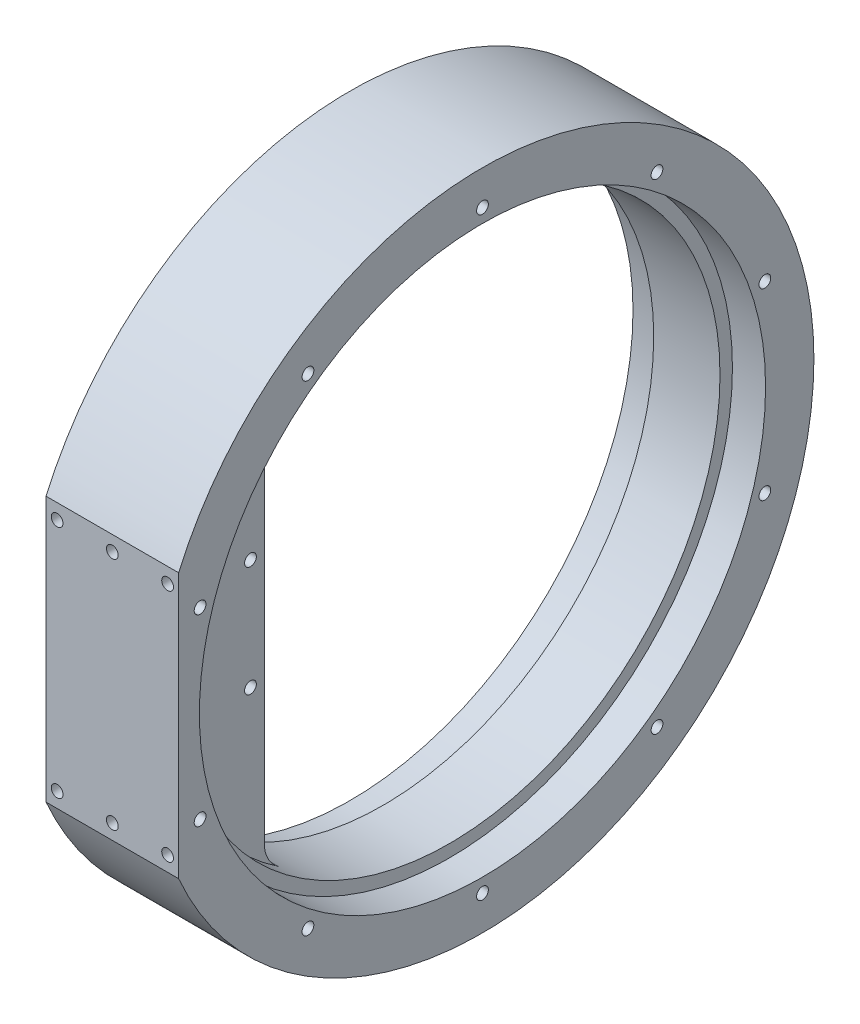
ISO-10303-21;
HEADER;
FILE_DESCRIPTION(('STEP AP214'),'2;1');
FILE_NAME('part.step','',(''),(''),'','','');
FILE_SCHEMA(('AUTOMOTIVE_DESIGN { 1 0 10303 214 1 1 1 1 }'));
ENDSEC;
DATA;
#1=APPLICATION_CONTEXT('core data for automotive mechanical design processes');
#2=APPLICATION_PROTOCOL_DEFINITION('international standard','automotive_design',2000,#1);
#3=PRODUCT_CONTEXT('',#1,'mechanical');
#4=PRODUCT('Part','Part','',(#3));
#5=PRODUCT_RELATED_PRODUCT_CATEGORY('part','',(#4));
#6=PRODUCT_DEFINITION_FORMATION('','',#4);
#7=PRODUCT_DEFINITION_CONTEXT('part definition',#1,'design');
#8=PRODUCT_DEFINITION('design','',#6,#7);
#9=PRODUCT_DEFINITION_SHAPE('','',#8);
#10=(LENGTH_UNIT() NAMED_UNIT(*) SI_UNIT(.MILLI.,.METRE.));
#11=(NAMED_UNIT(*) PLANE_ANGLE_UNIT() SI_UNIT($,.RADIAN.));
#12=(NAMED_UNIT(*) SI_UNIT($,.STERADIAN.) SOLID_ANGLE_UNIT());
#13=UNCERTAINTY_MEASURE_WITH_UNIT(LENGTH_MEASURE(1.E-05),#10,'distance_accuracy_value','');
#14=(GEOMETRIC_REPRESENTATION_CONTEXT(3) GLOBAL_UNCERTAINTY_ASSIGNED_CONTEXT((#13)) GLOBAL_UNIT_ASSIGNED_CONTEXT((#10,
#11,#12)) REPRESENTATION_CONTEXT('',''));
#15=CARTESIAN_POINT('',(0.,0.,0.));
#16=DIRECTION('',(0.,0.,1.));
#17=DIRECTION('',(1.,0.,0.));
#18=AXIS2_PLACEMENT_3D('',#15,#16,#17);
#19=CARTESIAN_POINT('',(-58.8598073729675,-76.2,69.85));
#20=DIRECTION('',(0.,0.,-1.));
#21=DIRECTION('',(-1.,0.,0.));
#22=AXIS2_PLACEMENT_3D('',#19,#20,#21);
#23=PLANE('',#22);
#24=CARTESIAN_POINT('',(-20.32,26.9875,69.85));
#25=DIRECTION('',(0.,0.,1.));
#26=DIRECTION('',(1.,0.,0.));
#27=AXIS2_PLACEMENT_3D('',#24,#25,#26);
#28=CIRCLE('',#27,1.35254999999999);
#29=CARTESIAN_POINT('',(-18.96745,26.9875,69.85));
#30=VERTEX_POINT('',#29);
#31=EDGE_CURVE('E298',#30,#30,#28,.T.);
#32=ORIENTED_EDGE('',*,*,#31,.F.);
#33=EDGE_LOOP('',(#32));
#34=FACE_BOUND('',#33,.T.);
#35=CARTESIAN_POINT('',(5.08,-26.9875,69.85));
#36=DIRECTION('',(0.,0.,1.));
#37=DIRECTION('',(1.,0.,0.));
#38=AXIS2_PLACEMENT_3D('',#35,#36,#37);
#39=CIRCLE('',#38,1.35254999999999);
#40=CARTESIAN_POINT('',(6.43254999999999,-26.9875,69.85));
#41=VERTEX_POINT('',#40);
#42=EDGE_CURVE('E836',#41,#41,#39,.T.);
#43=ORIENTED_EDGE('',*,*,#42,.F.);
#44=EDGE_LOOP('',(#43));
#45=FACE_BOUND('',#44,.T.);
#46=CARTESIAN_POINT('',(-7.62,26.9875,69.85));
#47=DIRECTION('',(0.,0.,1.));
#48=DIRECTION('',(1.,0.,0.));
#49=AXIS2_PLACEMENT_3D('',#46,#47,#48);
#50=CIRCLE('',#49,1.35254999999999);
#51=CARTESIAN_POINT('',(-6.26745000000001,26.9875,69.85));
#52=VERTEX_POINT('',#51);
#53=EDGE_CURVE('E843',#52,#52,#50,.T.);
#54=ORIENTED_EDGE('',*,*,#53,.F.);
#55=EDGE_LOOP('',(#54));
#56=FACE_BOUND('',#55,.T.);
#57=DIRECTION('',(0.,1.,0.));
#58=VECTOR('',#57,1.);
#59=CARTESIAN_POINT('',(7.62,65.0875,69.85));
#60=LINE('',#59,#58);
#61=CARTESIAN_POINT('',(7.62,-30.4535301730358,69.85));
#62=VERTEX_POINT('',#61);
#63=CARTESIAN_POINT('',(7.62,30.4535301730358,69.85));
#64=VERTEX_POINT('',#63);
#65=EDGE_CURVE('E857',#62,#64,#60,.T.);
#66=ORIENTED_EDGE('',*,*,#65,.T.);
#67=DIRECTION('',(1.,0.,0.));
#68=VECTOR('',#67,1.);
#69=CARTESIAN_POINT('',(0.,30.4535301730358,69.85));
#70=LINE('',#69,#68);
#71=CARTESIAN_POINT('',(-22.86,30.4535301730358,69.85));
#72=VERTEX_POINT('',#71);
#73=EDGE_CURVE('E161',#64,#72,#70,.F.);
#74=ORIENTED_EDGE('',*,*,#73,.T.);
#75=DIRECTION('',(0.,-1.,0.));
#76=VECTOR('',#75,1.);
#77=CARTESIAN_POINT('',(-22.86,65.0875,69.85));
#78=LINE('',#77,#76);
#79=CARTESIAN_POINT('',(-22.86,-30.4535301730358,69.85));
#80=VERTEX_POINT('',#79);
#81=EDGE_CURVE('E155',#72,#80,#78,.T.);
#82=ORIENTED_EDGE('',*,*,#81,.T.);
#83=DIRECTION('',(1.,0.,0.));
#84=VECTOR('',#83,1.);
#85=CARTESIAN_POINT('',(0.,-30.4535301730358,69.85));
#86=LINE('',#85,#84);
#87=EDGE_CURVE('E158',#80,#62,#86,.T.);
#88=ORIENTED_EDGE('',*,*,#87,.T.);
#89=EDGE_LOOP('',(#66,#74,#82,#88));
#90=FACE_BOUND('',#89,.T.);
#91=CARTESIAN_POINT('',(-7.62,-26.9875,69.85));
#92=DIRECTION('',(0.,0.,1.));
#93=DIRECTION('',(1.,0.,0.));
#94=AXIS2_PLACEMENT_3D('',#91,#92,#93);
#95=CIRCLE('',#94,1.35254999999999);
#96=CARTESIAN_POINT('',(-6.26745000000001,-26.9875,69.85));
#97=VERTEX_POINT('',#96);
#98=EDGE_CURVE('E835',#97,#97,#95,.T.);
#99=ORIENTED_EDGE('',*,*,#98,.F.);
#100=EDGE_LOOP('',(#99));
#101=FACE_BOUND('',#100,.T.);
#102=CARTESIAN_POINT('',(-20.32,-26.9875,69.85));
#103=DIRECTION('',(0.,0.,1.));
#104=DIRECTION('',(1.,0.,0.));
#105=AXIS2_PLACEMENT_3D('',#102,#103,#104);
#106=CIRCLE('',#105,1.35254999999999);
#107=CARTESIAN_POINT('',(-18.96745,-26.9875,69.85));
#108=VERTEX_POINT('',#107);
#109=EDGE_CURVE('E1023',#108,#108,#106,.T.);
#110=ORIENTED_EDGE('',*,*,#109,.F.);
#111=EDGE_LOOP('',(#110));
#112=FACE_BOUND('',#111,.T.);
#113=CARTESIAN_POINT('',(5.08,26.9875,69.85));
#114=DIRECTION('',(0.,0.,1.));
#115=DIRECTION('',(1.,0.,0.));
#116=AXIS2_PLACEMENT_3D('',#113,#114,#115);
#117=CIRCLE('',#116,1.35254999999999);
#118=CARTESIAN_POINT('',(6.43254999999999,26.9875,69.85));
#119=VERTEX_POINT('',#118);
#120=EDGE_CURVE('E277',#119,#119,#117,.T.);
#121=ORIENTED_EDGE('',*,*,#120,.F.);
#122=EDGE_LOOP('',(#121));
#123=FACE_BOUND('',#122,.T.);
#124=ADVANCED_FACE('F42',(#34,#45,#56,#90,#101,#112,#123),#23,.F.);
#125=CARTESIAN_POINT('',(0.,0.,0.));
#126=DIRECTION('',(1.,0.,0.));
#127=DIRECTION('',(0.,0.,-1.));
#128=AXIS2_PLACEMENT_3D('',#125,#126,#127);
#129=CYLINDRICAL_SURFACE('',#128,62.23);
#130=CARTESIAN_POINT('',(-4.445,0.,0.));
#131=DIRECTION('',(-1.,0.,0.));
#132=DIRECTION('',(0.,0.,1.));
#133=AXIS2_PLACEMENT_3D('',#130,#131,#132);
#134=CIRCLE('',#133,62.23);
#135=CARTESIAN_POINT('',(-4.445,-51.6351623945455,34.733023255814));
#136=VERTEX_POINT('',#135);
#137=CARTESIAN_POINT('',(-4.445,51.6351623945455,34.733023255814));
#138=VERTEX_POINT('',#137);
#139=EDGE_CURVE('E59',#136,#138,#134,.T.);
#140=ORIENTED_EDGE('',*,*,#139,.T.);
#141=DIRECTION('',(1.,0.,0.));
#142=VECTOR('',#141,1.);
#143=CARTESIAN_POINT('',(0.,51.6351623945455,34.733023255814));
#144=LINE('',#143,#142);
#145=CARTESIAN_POINT('',(-10.795,51.6351623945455,34.733023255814));
#146=VERTEX_POINT('',#145);
#147=EDGE_CURVE('E269',#138,#146,#144,.F.);
#148=ORIENTED_EDGE('',*,*,#147,.T.);
#149=CARTESIAN_POINT('',(-10.795,0.,0.));
#150=DIRECTION('',(-1.,0.,0.));
#151=DIRECTION('',(0.,0.,1.));
#152=AXIS2_PLACEMENT_3D('',#149,#150,#151);
#153=CIRCLE('',#152,62.23);
#154=CARTESIAN_POINT('',(-10.795,-51.6351623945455,34.733023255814));
#155=VERTEX_POINT('',#154);
#156=EDGE_CURVE('E66',#155,#146,#153,.T.);
#157=ORIENTED_EDGE('',*,*,#156,.F.);
#158=DIRECTION('',(1.,0.,0.));
#159=VECTOR('',#158,1.);
#160=CARTESIAN_POINT('',(0.,-51.6351623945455,34.733023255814));
#161=LINE('',#160,#159);
#162=EDGE_CURVE('E267',#155,#136,#161,.T.);
#163=ORIENTED_EDGE('',*,*,#162,.T.);
#164=EDGE_LOOP('',(#140,#148,#157,#163));
#165=FACE_BOUND('',#164,.T.);
#166=CARTESIAN_POINT('',(0.,0.,0.));
#167=DIRECTION('',(1.,0.,0.));
#168=DIRECTION('',(0.,0.,-1.));
#169=AXIS2_PLACEMENT_3D('',#166,#167,#168);
#170=CIRCLE('',#169,62.23);
#171=CARTESIAN_POINT('',(0.,0.,-62.23));
#172=VERTEX_POINT('',#171);
#173=EDGE_CURVE('E166',#172,#172,#170,.T.);
#174=ORIENTED_EDGE('',*,*,#173,.T.);
#175=EDGE_LOOP('',(#174));
#176=FACE_BOUND('',#175,.T.);
#177=CARTESIAN_POINT('',(-15.24,0.,0.));
#178=DIRECTION('',(1.,0.,0.));
#179=DIRECTION('',(0.,0.,-1.));
#180=AXIS2_PLACEMENT_3D('',#177,#178,#179);
#181=CIRCLE('',#180,62.23);
#182=CARTESIAN_POINT('',(-15.24,0.,-62.23));
#183=VERTEX_POINT('',#182);
#184=EDGE_CURVE('E191',#183,#183,#181,.T.);
#185=ORIENTED_EDGE('',*,*,#184,.F.);
#186=EDGE_LOOP('',(#185));
#187=FACE_BOUND('',#186,.T.);
#188=ADVANCED_FACE('F44',(#165,#176,#187),#129,.F.);
#189=CARTESIAN_POINT('',(0.,62.23,0.));
#190=DIRECTION('',(1.,0.,0.));
#191=DIRECTION('',(0.,0.,-1.));
#192=AXIS2_PLACEMENT_3D('',#189,#190,#191);
#193=PLANE('',#192);
#194=CARTESIAN_POINT('',(0.,0.,0.));
#195=DIRECTION('',(1.,0.,0.));
#196=DIRECTION('',(0.,0.,-1.));
#197=AXIS2_PLACEMENT_3D('',#194,#195,#196);
#198=CIRCLE('',#197,65.0875);
#199=CARTESIAN_POINT('',(0.,0.,-65.0875));
#200=VERTEX_POINT('',#199);
#201=EDGE_CURVE('E258',#200,#200,#198,.T.);
#202=ORIENTED_EDGE('',*,*,#201,.T.);
#203=EDGE_LOOP('',(#202));
#204=FACE_BOUND('',#203,.T.);
#205=ORIENTED_EDGE('',*,*,#173,.F.);
#206=EDGE_LOOP('',(#205));
#207=FACE_BOUND('',#206,.T.);
#208=ADVANCED_FACE('F334',(#204,#207),#193,.T.);
#209=CARTESIAN_POINT('',(0.,0.,0.));
#210=DIRECTION('',(1.,0.,0.));
#211=DIRECTION('',(0.,0.,-1.));
#212=AXIS2_PLACEMENT_3D('',#209,#210,#211);
#213=CYLINDRICAL_SURFACE('',#212,65.0875);
#214=CARTESIAN_POINT('',(6.43254999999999,26.9875,59.228856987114));
#215=CARTESIAN_POINT('',(6.43254735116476,26.9060959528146,59.2659482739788));
#216=CARTESIAN_POINT('',(6.4251877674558,26.8245519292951,59.3028991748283));
#217=CARTESIAN_POINT('',(6.39571677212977,26.6634644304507,59.3755012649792));
#218=CARTESIAN_POINT('',(6.37358595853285,26.5839237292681,59.4111506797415));
#219=CARTESIAN_POINT('',(6.3147015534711,26.4291364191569,59.4801697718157));
#220=CARTESIAN_POINT('',(6.27791891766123,26.353898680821,59.5135347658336));
#221=CARTESIAN_POINT('',(6.19028042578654,26.2105050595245,59.5768262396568));
#222=CARTESIAN_POINT('',(6.13943205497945,26.1423454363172,59.6067545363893));
#223=CARTESIAN_POINT('',(6.02790679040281,26.0193208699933,59.6605553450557));
#224=CARTESIAN_POINT('',(5.96793157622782,25.9639281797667,59.6846716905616));
#225=CARTESIAN_POINT('',(5.83783459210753,25.8642090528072,59.7279524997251));
#226=CARTESIAN_POINT('',(5.76771870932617,25.8198762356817,59.747119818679));
#227=CARTESIAN_POINT('',(5.6260346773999,25.7477452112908,59.7782375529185));
#228=CARTESIAN_POINT('',(5.5551399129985,25.7188336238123,59.7906753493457));
#229=CARTESIAN_POINT('',(5.40881964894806,25.6732968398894,59.8102425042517));
#230=CARTESIAN_POINT('',(5.33339649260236,25.6566653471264,59.8173745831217));
#231=CARTESIAN_POINT('',(5.18592145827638,25.6371995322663,59.8257198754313));
#232=CARTESIAN_POINT('',(5.11400750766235,25.6334740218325,59.8273154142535));
#233=CARTESIAN_POINT('',(4.97056609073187,25.6374777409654,59.8255998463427));
#234=CARTESIAN_POINT('',(4.89903855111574,25.6452047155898,59.8222897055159));
#235=CARTESIAN_POINT('',(4.76018777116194,25.6714509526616,59.8110312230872));
#236=CARTESIAN_POINT('',(4.69280471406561,25.6897050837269,59.8031968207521));
#237=CARTESIAN_POINT('',(4.56220079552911,25.736069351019,59.7832587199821));
#238=CARTESIAN_POINT('',(4.49898023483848,25.7641801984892,59.7711547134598));
#239=CARTESIAN_POINT('',(4.37657746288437,25.8301103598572,59.7426930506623));
#240=CARTESIAN_POINT('',(4.31755071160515,25.8681716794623,59.7262292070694));
#241=CARTESIAN_POINT('',(4.20675340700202,25.9522831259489,59.6897290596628));
#242=CARTESIAN_POINT('',(4.15498467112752,25.998335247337,59.6696918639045));
#243=CARTESIAN_POINT('',(4.05649362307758,26.1002720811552,59.625177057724));
#244=CARTESIAN_POINT('',(4.01032843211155,26.1566046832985,59.6004938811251));
#245=CARTESIAN_POINT('',(3.92805065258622,26.2750332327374,59.548379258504));
#246=CARTESIAN_POINT('',(3.89194154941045,26.3371311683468,59.520946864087));
#247=CARTESIAN_POINT('',(3.82767054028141,26.4707752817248,59.4616387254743));
#248=CARTESIAN_POINT('',(3.80041551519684,26.5426779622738,59.4295831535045));
#249=CARTESIAN_POINT('',(3.75851309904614,26.6893592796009,59.3638545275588));
#250=CARTESIAN_POINT('',(3.74387029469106,26.7641389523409,59.3301808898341));
#251=CARTESIAN_POINT('',(3.72669139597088,26.9201433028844,59.2595678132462));
#252=CARTESIAN_POINT('',(3.72509945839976,27.0014454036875,59.222567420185));
#253=CARTESIAN_POINT('',(3.73644714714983,27.1630678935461,59.1486120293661));
#254=CARTESIAN_POINT('',(3.74939083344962,27.2433880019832,59.1116570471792));
#255=CARTESIAN_POINT('',(3.79021348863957,27.4032505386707,59.0377209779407));
#256=CARTESIAN_POINT('',(3.81852837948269,27.4826975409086,59.0007722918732));
#257=CARTESIAN_POINT('',(3.88995444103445,27.6358187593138,58.9292060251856));
#258=CARTESIAN_POINT('',(3.93306515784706,27.709493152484,58.8945883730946));
#259=CARTESIAN_POINT('',(4.03166392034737,27.846126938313,58.8301061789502));
#260=CARTESIAN_POINT('',(4.0866874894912,27.9093631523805,58.8001210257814));
#261=CARTESIAN_POINT('',(4.20875163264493,28.025478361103,58.7448666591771));
#262=CARTESIAN_POINT('',(4.2757846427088,28.0783638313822,58.7195944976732));
#263=CARTESIAN_POINT('',(4.41356267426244,28.1670558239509,58.677098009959));
#264=CARTESIAN_POINT('',(4.48343337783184,28.2039697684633,58.6593546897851));
#265=CARTESIAN_POINT('',(4.62961422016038,28.2653150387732,58.6298199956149));
#266=CARTESIAN_POINT('',(4.70591918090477,28.2897562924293,58.6180238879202));
#267=CARTESIAN_POINT('',(4.85454077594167,28.3230799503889,58.6019291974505));
#268=CARTESIAN_POINT('',(4.92649825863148,28.3332690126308,58.5970011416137));
#269=CARTESIAN_POINT('',(5.071270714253,28.3419619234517,58.5927971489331));
#270=CARTESIAN_POINT('',(5.14408536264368,28.340470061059,58.5935191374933));
#271=CARTESIAN_POINT('',(5.28447284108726,28.3262684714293,58.6003858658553));
#272=CARTESIAN_POINT('',(5.35212075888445,28.3141489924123,58.6062452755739));
#273=CARTESIAN_POINT('',(5.48425911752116,28.2800257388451,58.6227187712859));
#274=CARTESIAN_POINT('',(5.54874946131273,28.2580216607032,58.6333330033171));
#275=CARTESIAN_POINT('',(5.67413537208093,28.2045159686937,58.6590898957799));
#276=CARTESIAN_POINT('',(5.73494222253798,28.1728459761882,58.6743127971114));
#277=CARTESIAN_POINT('',(5.85032356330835,28.1013241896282,58.7086007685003));
#278=CARTESIAN_POINT('',(5.90489665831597,28.0614705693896,58.7276666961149));
#279=CARTESIAN_POINT('',(6.01061500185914,27.971627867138,58.7705142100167));
#280=CARTESIAN_POINT('',(6.06120870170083,27.921107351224,58.7945401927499));
#281=CARTESIAN_POINT('',(6.15328799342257,27.8136111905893,58.845469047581));
#282=CARTESIAN_POINT('',(6.19476771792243,27.7566314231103,58.8723737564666));
#283=CARTESIAN_POINT('',(6.2716045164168,27.6319663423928,58.9309958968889));
#284=CARTESIAN_POINT('',(6.30598255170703,27.5637785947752,58.9629271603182));
#285=CARTESIAN_POINT('',(6.362639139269,27.4233395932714,59.0283753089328));
#286=CARTESIAN_POINT('',(6.38492693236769,27.3510914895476,59.0618909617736));
#287=CARTESIAN_POINT('',(6.41152834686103,27.2300097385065,59.117780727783));
#288=CARTESIAN_POINT('',(6.41940274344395,27.1818322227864,59.1399483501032));
#289=CARTESIAN_POINT('',(6.42991450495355,27.0849532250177,59.1843797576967));
#290=CARTESIAN_POINT('',(6.43255158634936,27.0362517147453,59.2066435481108));
#291=CARTESIAN_POINT('',(6.43254999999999,26.9875,59.228856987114));
#292=B_SPLINE_CURVE_WITH_KNOTS('',3,(#214,#215,#216,#217,#218,#219,#220,#221,#222,#223,#224,
#225,#226,#227,#228,#229,#230,#231,#232,#233,#234,#235,#236,#237,#238,#239,#240,#241,#242,#243,
#244,#245,#246,#247,#248,#249,#250,#251,#252,#253,#254,#255,#256,#257,#258,#259,#260,#261,#262,
#263,#264,#265,#266,#267,#268,#269,#270,#271,#272,#273,#274,#275,#276,#277,#278,#279,#280,#281,
#282,#283,#284,#285,#286,#287,#288,#289,#290,#291),.UNSPECIFIED.,.T.,.F.,(4,2,2,2,2,2,2,2,2,2,2,
2,2,2,2,2,2,2,2,2,2,2,2,2,2,2,2,2,2,2,2,2,2,2,2,2,2,2,4),(0.,0.268180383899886,
0.536713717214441,0.805782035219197,1.07470743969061,1.32871494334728,1.58257557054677,
1.81404850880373,2.04540268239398,2.26042314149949,2.47540126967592,2.68518784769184,
2.89498956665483,3.11046540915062,3.32599511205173,3.55572350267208,3.7855314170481,
4.03438878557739,4.28333661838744,4.55014853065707,4.81703498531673,5.09191885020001,
5.36679428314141,5.63243519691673,5.89790938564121,6.13953687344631,6.38097173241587,
6.59837192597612,6.815692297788,7.02165687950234,7.22762778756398,7.43741402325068,
7.64724712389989,7.87259046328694,8.09807845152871,8.34535687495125,8.59244603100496,
8.75304671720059,8.91365609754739),.UNSPECIFIED.);
#293=CARTESIAN_POINT('',(6.43254999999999,26.9875,59.228856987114));
#294=VERTEX_POINT('',#293);
#295=EDGE_CURVE('E282',#294,#294,#292,.T.);
#296=ORIENTED_EDGE('',*,*,#295,.F.);
#297=EDGE_LOOP('',(#296));
#298=FACE_BOUND('',#297,.T.);
#299=CARTESIAN_POINT('',(6.43254999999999,-26.9875,59.228856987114));
#300=CARTESIAN_POINT('',(6.43254729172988,-27.0699453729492,59.1912906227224));
#301=CARTESIAN_POINT('',(6.4249975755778,-27.1523808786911,59.1535192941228));
#302=CARTESIAN_POINT('',(6.39492971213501,-27.3149126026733,59.0786445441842));
#303=CARTESIAN_POINT('',(6.37238846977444,-27.3950050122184,59.0415422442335));
#304=CARTESIAN_POINT('',(6.31260239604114,-27.5505552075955,58.9691184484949));
#305=CARTESIAN_POINT('',(6.27533736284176,-27.6260064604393,58.9337994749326));
#306=CARTESIAN_POINT('',(6.1866840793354,-27.769649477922,58.8662511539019));
#307=CARTESIAN_POINT('',(6.1353028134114,-27.8378448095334,58.8340202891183));
#308=CARTESIAN_POINT('',(6.02219287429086,-27.9613245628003,58.7754322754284));
#309=CARTESIAN_POINT('',(5.96107907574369,-28.0170715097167,58.7488674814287));
#310=CARTESIAN_POINT('',(5.82835996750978,-28.1172094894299,58.7010074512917));
#311=CARTESIAN_POINT('',(5.75676199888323,-28.1616084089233,58.679708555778));
#312=CARTESIAN_POINT('',(5.61275382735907,-28.233041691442,58.6453700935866));
#313=CARTESIAN_POINT('',(5.54112598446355,-28.2613601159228,58.6317215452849));
#314=CARTESIAN_POINT('',(5.39328575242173,-28.3055219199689,58.6104145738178));
#315=CARTESIAN_POINT('',(5.31707660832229,-28.3213740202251,58.6027519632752));
#316=CARTESIAN_POINT('',(5.16968294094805,-28.3389270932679,58.5942655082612));
#317=CARTESIAN_POINT('',(5.09866462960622,-28.3417747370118,58.5928875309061));
#318=CARTESIAN_POINT('',(4.95716834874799,-28.3363189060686,58.595526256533));
#319=CARTESIAN_POINT('',(4.88669025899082,-28.328017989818,58.5995417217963));
#320=CARTESIAN_POINT('',(4.7505123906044,-28.3010832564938,58.6125545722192));
#321=CARTESIAN_POINT('',(4.68473230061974,-28.2827755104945,58.62139473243));
#322=CARTESIAN_POINT('',(4.5573324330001,-28.2368189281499,58.6435449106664));
#323=CARTESIAN_POINT('',(4.49571313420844,-28.2091690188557,58.6568554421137));
#324=CARTESIAN_POINT('',(4.37574645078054,-28.144325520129,58.6879965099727));
#325=CARTESIAN_POINT('',(4.31761607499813,-28.106805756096,58.7059812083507));
#326=CARTESIAN_POINT('',(4.20847388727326,-28.0240940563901,58.7455096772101));
#327=CARTESIAN_POINT('',(4.15746435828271,-27.9788996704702,58.7670545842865));
#328=CARTESIAN_POINT('',(4.0593883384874,-27.8780613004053,58.8149617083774));
#329=CARTESIAN_POINT('',(4.01302336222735,-27.821856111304,58.8415775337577));
#330=CARTESIAN_POINT('',(3.93032170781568,-27.7036299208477,58.8973328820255));
#331=CARTESIAN_POINT('',(3.89398909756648,-27.6416065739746,58.9264734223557));
#332=CARTESIAN_POINT('',(3.82883596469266,-27.5071863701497,58.9893495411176));
#333=CARTESIAN_POINT('',(3.8010590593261,-27.4343639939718,59.0232585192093));
#334=CARTESIAN_POINT('',(3.75842395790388,-27.2855369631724,59.092206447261));
#335=CARTESIAN_POINT('',(3.74357061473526,-27.2095311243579,59.127245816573));
#336=CARTESIAN_POINT('',(3.72644150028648,-27.0510516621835,59.1999269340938));
#337=CARTESIAN_POINT('',(3.72507559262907,-26.9684860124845,59.2375856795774));
#338=CARTESIAN_POINT('',(3.73740676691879,-26.8041168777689,59.3121414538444));
#339=CARTESIAN_POINT('',(3.75110666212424,-26.7223135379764,59.3490383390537));
#340=CARTESIAN_POINT('',(3.79371798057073,-26.561004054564,59.4214070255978));
#341=CARTESIAN_POINT('',(3.82278445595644,-26.4815302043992,59.4568602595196));
#342=CARTESIAN_POINT('',(3.8958738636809,-26.3283874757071,59.5248325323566));
#343=CARTESIAN_POINT('',(3.93989355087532,-26.2547173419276,59.5573522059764));
#344=CARTESIAN_POINT('',(4.03949365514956,-26.1194975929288,59.6167735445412));
#345=CARTESIAN_POINT('',(4.09437473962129,-26.0575228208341,59.6438764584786));
#346=CARTESIAN_POINT('',(4.21567870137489,-25.9438349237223,59.6934161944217));
#347=CARTESIAN_POINT('',(4.28209464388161,-25.892115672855,59.7158558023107));
#348=CARTESIAN_POINT('',(4.41842105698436,-25.8052707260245,59.7534326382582));
#349=CARTESIAN_POINT('',(4.48753794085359,-25.7690995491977,59.7690323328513));
#350=CARTESIAN_POINT('',(4.63181733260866,-25.7089774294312,59.7949179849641));
#351=CARTESIAN_POINT('',(4.70697632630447,-25.6850194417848,59.8052070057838));
#352=CARTESIAN_POINT('',(4.85474008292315,-25.6518636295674,59.8194353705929));
#353=CARTESIAN_POINT('',(4.92707528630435,-25.6416466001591,59.82381327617));
#354=CARTESIAN_POINT('',(5.07256784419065,-25.633010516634,59.8275141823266));
#355=CARTESIAN_POINT('',(5.14572496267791,-25.6345881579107,59.8268385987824));
#356=CARTESIAN_POINT('',(5.28783118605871,-25.6491778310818,59.8205849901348));
#357=CARTESIAN_POINT('',(5.35683434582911,-25.6617512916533,59.8151949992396));
#358=CARTESIAN_POINT('',(5.49161144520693,-25.6972195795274,59.799965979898));
#359=CARTESIAN_POINT('',(5.5573853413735,-25.7201145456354,59.7901268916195));
#360=CARTESIAN_POINT('',(5.68490639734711,-25.7757300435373,59.7661720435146));
#361=CARTESIAN_POINT('',(5.74658490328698,-25.8085826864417,59.7519987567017));
#362=CARTESIAN_POINT('',(5.86347996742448,-25.8828066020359,59.7198845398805));
#363=CARTESIAN_POINT('',(5.91869547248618,-25.9241792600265,59.7019429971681));
#364=CARTESIAN_POINT('',(6.02452627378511,-26.0166866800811,59.6616908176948));
#365=CARTESIAN_POINT('',(6.07469892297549,-26.0682439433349,59.6391892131));
#366=CARTESIAN_POINT('',(6.16574361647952,-26.1777896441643,59.5911869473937));
#367=CARTESIAN_POINT('',(6.20661020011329,-26.2357818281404,59.5656845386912));
#368=CARTESIAN_POINT('',(6.28137637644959,-26.3615109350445,59.5101545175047));
#369=CARTESIAN_POINT('',(6.31443889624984,-26.4296568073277,59.4799275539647));
#370=CARTESIAN_POINT('',(6.36856861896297,-26.5696387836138,59.4175294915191));
#371=CARTESIAN_POINT('',(6.38964562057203,-26.6414718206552,59.3853600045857));
#372=CARTESIAN_POINT('',(6.41395736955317,-26.7593110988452,59.3323215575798));
#373=CARTESIAN_POINT('',(6.42092962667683,-26.8047433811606,59.3118107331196));
#374=CARTESIAN_POINT('',(6.4302267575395,-26.8959514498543,59.2705066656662));
#375=CARTESIAN_POINT('',(6.43255150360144,-26.941727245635,59.24971341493));
#376=CARTESIAN_POINT('',(6.43254999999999,-26.9875,59.228856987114));
#377=B_SPLINE_CURVE_WITH_KNOTS('',3,(#299,#300,#301,#302,#303,#304,#305,#306,#307,#308,#309,
#310,#311,#312,#313,#314,#315,#316,#317,#318,#319,#320,#321,#322,#323,#324,#325,#326,#327,#328,
#329,#330,#331,#332,#333,#334,#335,#336,#337,#338,#339,#340,#341,#342,#343,#344,#345,#346,#347,
#348,#349,#350,#351,#352,#353,#354,#355,#356,#357,#358,#359,#360,#361,#362,#363,#364,#365,#366,
#367,#368,#369,#370,#371,#372,#373,#374,#375,#376),.UNSPECIFIED.,.T.,.F.,(4,2,2,2,2,2,2,2,2,2,2,
2,2,2,2,2,2,2,2,2,2,2,2,2,2,2,2,2,2,2,2,2,2,2,2,2,2,2,4),(0.,0.271622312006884,
0.543664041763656,0.816080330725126,1.08836207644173,1.34757756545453,1.60661241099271,
1.83999905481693,2.07322228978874,2.28542505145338,2.49757912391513,2.70319996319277,
2.90884442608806,3.12239863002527,3.33602114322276,3.56776449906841,3.79960168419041,
4.05349663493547,4.307486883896,4.57850301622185,4.84956976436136,5.12342535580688,
5.39722155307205,5.65713540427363,5.91689353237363,6.15428035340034,6.39153009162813,
6.60997926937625,6.82836724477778,7.03842271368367,7.24848100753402,7.46145818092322,
7.67447001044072,7.89964383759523,8.12494945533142,8.36858137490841,8.61201382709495,
8.76281137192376,8.91361305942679),.UNSPECIFIED.);
#378=CARTESIAN_POINT('',(6.43254999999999,-26.9875,59.228856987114));
#379=VERTEX_POINT('',#378);
#380=EDGE_CURVE('E829',#379,#379,#377,.T.);
#381=ORIENTED_EDGE('',*,*,#380,.F.);
#382=EDGE_LOOP('',(#381));
#383=FACE_BOUND('',#382,.T.);
#384=CARTESIAN_POINT('',(7.62,0.,0.));
#385=DIRECTION('',(1.,0.,0.));
#386=DIRECTION('',(0.,0.,-1.));
#387=AXIS2_PLACEMENT_3D('',#384,#385,#386);
#388=CIRCLE('',#387,65.0875);
#389=CARTESIAN_POINT('',(7.62,0.,-65.0875));
#390=VERTEX_POINT('',#389);
#391=EDGE_CURVE('E255',#390,#390,#388,.T.);
#392=ORIENTED_EDGE('',*,*,#391,.T.);
#393=EDGE_LOOP('',(#392));
#394=FACE_BOUND('',#393,.T.);
#395=ORIENTED_EDGE('',*,*,#201,.F.);
#396=EDGE_LOOP('',(#395));
#397=FACE_BOUND('',#396,.T.);
#398=ADVANCED_FACE('F515',(#298,#383,#394,#397),#213,.F.);
#399=CARTESIAN_POINT('',(7.62,65.0875,0.));
#400=DIRECTION('',(1.,0.,0.));
#401=DIRECTION('',(0.,0.,-1.));
#402=AXIS2_PLACEMENT_3D('',#399,#400,#401);
#403=PLANE('',#402);
#404=ORIENTED_EDGE('',*,*,#65,.F.);
#405=CARTESIAN_POINT('',(7.62,0.,0.));
#406=DIRECTION('',(1.,0.,0.));
#407=DIRECTION('',(0.,0.,-1.));
#408=AXIS2_PLACEMENT_3D('',#405,#406,#407);
#409=CIRCLE('',#408,76.2);
#410=EDGE_CURVE('E173',#62,#64,#409,.T.);
#411=ORIENTED_EDGE('',*,*,#410,.T.);
#412=EDGE_LOOP('',(#404,#411));
#413=FACE_BOUND('',#412,.T.);
#414=CARTESIAN_POINT('',(7.62,55.2255225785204,-40.1236907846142));
#415=DIRECTION('',(1.,0.,0.));
#416=DIRECTION('',(0.,0.,-1.));
#417=AXIS2_PLACEMENT_3D('',#414,#415,#416);
#418=CIRCLE('',#417,1.35254999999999);
#419=CARTESIAN_POINT('',(7.62,55.2255225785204,-41.4762407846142));
#420=VERTEX_POINT('',#419);
#421=EDGE_CURVE('E197',#420,#420,#418,.T.);
#422=ORIENTED_EDGE('',*,*,#421,.F.);
#423=EDGE_LOOP('',(#422));
#424=FACE_BOUND('',#423,.T.);
#425=CARTESIAN_POINT('',(7.62,21.0942725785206,-64.9214954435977));
#426=DIRECTION('',(1.,0.,0.));
#427=DIRECTION('',(0.,0.,-1.));
#428=AXIS2_PLACEMENT_3D('',#425,#426,#427);
#429=CIRCLE('',#428,1.35254999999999);
#430=CARTESIAN_POINT('',(7.62,21.0942725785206,-66.2740454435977));
#431=VERTEX_POINT('',#430);
#432=EDGE_CURVE('E203',#431,#431,#429,.T.);
#433=ORIENTED_EDGE('',*,*,#432,.F.);
#434=EDGE_LOOP('',(#433));
#435=FACE_BOUND('',#434,.T.);
#436=CARTESIAN_POINT('',(7.62,-21.0942725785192,-64.9214954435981));
#437=DIRECTION('',(1.,0.,0.));
#438=DIRECTION('',(0.,0.,-1.));
#439=AXIS2_PLACEMENT_3D('',#436,#437,#438);
#440=CIRCLE('',#439,1.35254999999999);
#441=CARTESIAN_POINT('',(7.62,-21.0942725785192,-66.2740454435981));
#442=VERTEX_POINT('',#441);
#443=EDGE_CURVE('E209',#442,#442,#440,.T.);
#444=ORIENTED_EDGE('',*,*,#443,.F.);
#445=EDGE_LOOP('',(#444));
#446=FACE_BOUND('',#445,.T.);
#447=CARTESIAN_POINT('',(7.62,-55.2255225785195,-40.1236907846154));
#448=DIRECTION('',(1.,0.,0.));
#449=DIRECTION('',(0.,0.,-1.));
#450=AXIS2_PLACEMENT_3D('',#447,#448,#449);
#451=CIRCLE('',#450,1.35254999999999);
#452=CARTESIAN_POINT('',(7.62,-55.2255225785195,-41.4762407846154));
#453=VERTEX_POINT('',#452);
#454=EDGE_CURVE('E215',#453,#453,#451,.T.);
#455=ORIENTED_EDGE('',*,*,#454,.F.);
#456=EDGE_LOOP('',(#455));
#457=FACE_BOUND('',#456,.T.);
#458=CARTESIAN_POINT('',(7.62,-68.2625,-4.76674765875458E-13));
#459=DIRECTION('',(1.,0.,0.));
#460=DIRECTION('',(0.,0.,-1.));
#461=AXIS2_PLACEMENT_3D('',#458,#459,#460);
#462=CIRCLE('',#461,1.35254999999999);
#463=CARTESIAN_POINT('',(7.62,-68.2625,-1.35255000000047));
#464=VERTEX_POINT('',#463);
#465=EDGE_CURVE('E221',#464,#464,#462,.T.);
#466=ORIENTED_EDGE('',*,*,#465,.F.);
#467=EDGE_LOOP('',(#466));
#468=FACE_BOUND('',#467,.T.);
#469=CARTESIAN_POINT('',(7.62,-55.2255225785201,40.1236907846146));
#470=DIRECTION('',(1.,0.,0.));
#471=DIRECTION('',(0.,0.,-1.));
#472=AXIS2_PLACEMENT_3D('',#469,#470,#471);
#473=CIRCLE('',#472,1.35254999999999);
#474=CARTESIAN_POINT('',(7.62,-55.2255225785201,38.7711407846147));
#475=VERTEX_POINT('',#474);
#476=EDGE_CURVE('E227',#475,#475,#473,.T.);
#477=ORIENTED_EDGE('',*,*,#476,.F.);
#478=EDGE_LOOP('',(#477));
#479=FACE_BOUND('',#478,.T.);
#480=CARTESIAN_POINT('',(7.62,-21.0942725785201,64.9214954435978));
#481=DIRECTION('',(1.,0.,0.));
#482=DIRECTION('',(0.,0.,-1.));
#483=AXIS2_PLACEMENT_3D('',#480,#481,#482);
#484=CIRCLE('',#483,1.35254999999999);
#485=CARTESIAN_POINT('',(7.62,-21.0942725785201,63.5689454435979));
#486=VERTEX_POINT('',#485);
#487=EDGE_CURVE('E233',#486,#486,#484,.T.);
#488=ORIENTED_EDGE('',*,*,#487,.F.);
#489=EDGE_LOOP('',(#488));
#490=FACE_BOUND('',#489,.T.);
#491=CARTESIAN_POINT('',(7.62,21.0942725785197,64.921495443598));
#492=DIRECTION('',(1.,0.,0.));
#493=DIRECTION('',(0.,0.,-1.));
#494=AXIS2_PLACEMENT_3D('',#491,#492,#493);
#495=CIRCLE('',#494,1.35254999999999);
#496=CARTESIAN_POINT('',(7.62,21.0942725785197,63.568945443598));
#497=VERTEX_POINT('',#496);
#498=EDGE_CURVE('E239',#497,#497,#495,.T.);
#499=ORIENTED_EDGE('',*,*,#498,.F.);
#500=EDGE_LOOP('',(#499));
#501=FACE_BOUND('',#500,.T.);
#502=CARTESIAN_POINT('',(7.62,55.2255225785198,40.123690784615));
#503=DIRECTION('',(1.,0.,0.));
#504=DIRECTION('',(0.,0.,-1.));
#505=AXIS2_PLACEMENT_3D('',#502,#503,#504);
#506=CIRCLE('',#505,1.35254999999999);
#507=CARTESIAN_POINT('',(7.62,55.2255225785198,38.771140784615));
#508=VERTEX_POINT('',#507);
#509=EDGE_CURVE('E245',#508,#508,#506,.T.);
#510=ORIENTED_EDGE('',*,*,#509,.F.);
#511=EDGE_LOOP('',(#510));
#512=FACE_BOUND('',#511,.T.);
#513=CARTESIAN_POINT('',(7.62,68.2625,0.));
#514=DIRECTION('',(1.,0.,0.));
#515=DIRECTION('',(0.,0.,-1.));
#516=AXIS2_PLACEMENT_3D('',#513,#514,#515);
#517=CIRCLE('',#516,1.35254999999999);
#518=CARTESIAN_POINT('',(7.62,68.2625,-1.35254999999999));
#519=VERTEX_POINT('',#518);
#520=EDGE_CURVE('E251',#519,#519,#517,.T.);
#521=ORIENTED_EDGE('',*,*,#520,.F.);
#522=EDGE_LOOP('',(#521));
#523=FACE_BOUND('',#522,.T.);
#524=ORIENTED_EDGE('',*,*,#391,.F.);
#525=EDGE_LOOP('',(#524));
#526=FACE_BOUND('',#525,.T.);
#527=ADVANCED_FACE('F512',(#413,#424,#435,#446,#457,#468,#479,#490,#501,#512,#523,#526),#403,.T.);
#528=CARTESIAN_POINT('',(0.,0.,0.));
#529=DIRECTION('',(1.,0.,0.));
#530=DIRECTION('',(0.,0.,-1.));
#531=AXIS2_PLACEMENT_3D('',#528,#529,#530);
#532=CYLINDRICAL_SURFACE('',#531,76.2);
#533=ORIENTED_EDGE('',*,*,#73,.F.);
#534=ORIENTED_EDGE('',*,*,#410,.F.);
#535=ORIENTED_EDGE('',*,*,#87,.F.);
#536=CARTESIAN_POINT('',(-22.86,0.,0.));
#537=DIRECTION('',(1.,0.,0.));
#538=DIRECTION('',(0.,0.,-1.));
#539=AXIS2_PLACEMENT_3D('',#536,#537,#538);
#540=CIRCLE('',#539,76.2);
#541=EDGE_CURVE('E171',#80,#72,#540,.T.);
#542=ORIENTED_EDGE('',*,*,#541,.T.);
#543=EDGE_LOOP('',(#533,#534,#535,#542));
#544=FACE_BOUND('',#543,.T.);
#545=ADVANCED_FACE('F170',(#544),#532,.T.);
#546=CARTESIAN_POINT('',(7.62,68.2625,0.));
#547=DIRECTION('',(1.,0.,0.));
#548=DIRECTION('',(0.,0.,-1.));
#549=AXIS2_PLACEMENT_3D('',#546,#547,#548);
#550=CYLINDRICAL_SURFACE('',#549,1.35254999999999);
#551=CARTESIAN_POINT('',(-3.302,68.2625,0.));
#552=DIRECTION('',(1.,0.,0.));
#553=DIRECTION('',(0.,0.,-1.));
#554=AXIS2_PLACEMENT_3D('',#551,#552,#553);
#555=CIRCLE('',#554,1.35254999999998);
#556=CARTESIAN_POINT('',(-3.302,68.2625,-1.35254999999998));
#557=VERTEX_POINT('',#556);
#558=EDGE_CURVE('E248',#557,#557,#555,.T.);
#559=ORIENTED_EDGE('',*,*,#558,.F.);
#560=EDGE_LOOP('',(#559));
#561=FACE_BOUND('',#560,.T.);
#562=ORIENTED_EDGE('',*,*,#520,.T.);
#563=EDGE_LOOP('',(#562));
#564=FACE_BOUND('',#563,.T.);
#565=ADVANCED_FACE('F505',(#561,#564),#550,.F.);
#566=CARTESIAN_POINT('',(-3.302,68.2625,0.));
#567=DIRECTION('',(1.,0.,0.));
#568=DIRECTION('',(0.,0.,-1.));
#569=AXIS2_PLACEMENT_3D('',#566,#567,#568);
#570=CONICAL_SURFACE('',#569,1.35254999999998,0.785398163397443);
#571=CARTESIAN_POINT('',(-4.65455,68.2625,0.));
#572=VERTEX_POINT('',#571);
#573=VERTEX_LOOP('',#572);
#574=FACE_BOUND('',#573,.T.);
#575=ORIENTED_EDGE('',*,*,#558,.T.);
#576=EDGE_LOOP('',(#575));
#577=FACE_BOUND('',#576,.T.);
#578=ADVANCED_FACE('F501',(#574,#577),#570,.F.);
#579=CARTESIAN_POINT('',(7.62,55.2255225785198,40.123690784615));
#580=DIRECTION('',(1.,0.,0.));
#581=DIRECTION('',(0.,0.,-1.));
#582=AXIS2_PLACEMENT_3D('',#579,#580,#581);
#583=CYLINDRICAL_SURFACE('',#582,1.35254999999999);
#584=CARTESIAN_POINT('',(-3.302,55.2255225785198,40.123690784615));
#585=DIRECTION('',(1.,0.,0.));
#586=DIRECTION('',(0.,0.,-1.));
#587=AXIS2_PLACEMENT_3D('',#584,#585,#586);
#588=CIRCLE('',#587,1.35254999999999);
#589=CARTESIAN_POINT('',(-3.302,55.2255225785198,38.771140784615));
#590=VERTEX_POINT('',#589);
#591=EDGE_CURVE('E242',#590,#590,#588,.T.);
#592=ORIENTED_EDGE('',*,*,#591,.F.);
#593=EDGE_LOOP('',(#592));
#594=FACE_BOUND('',#593,.T.);
#595=ORIENTED_EDGE('',*,*,#509,.T.);
#596=EDGE_LOOP('',(#595));
#597=FACE_BOUND('',#596,.T.);
#598=ADVANCED_FACE('F497',(#594,#597),#583,.F.);
#599=CARTESIAN_POINT('',(-3.302,55.2255225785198,40.123690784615));
#600=DIRECTION('',(1.,0.,0.));
#601=DIRECTION('',(0.,0.,-1.));
#602=AXIS2_PLACEMENT_3D('',#599,#600,#601);
#603=CONICAL_SURFACE('',#602,1.35254999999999,0.785398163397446);
#604=CARTESIAN_POINT('',(-4.65455,55.2255225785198,40.123690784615));
#605=VERTEX_POINT('',#604);
#606=VERTEX_LOOP('',#605);
#607=FACE_BOUND('',#606,.T.);
#608=ORIENTED_EDGE('',*,*,#591,.T.);
#609=EDGE_LOOP('',(#608));
#610=FACE_BOUND('',#609,.T.);
#611=ADVANCED_FACE('F493',(#607,#610),#603,.F.);
#612=CARTESIAN_POINT('',(7.62,21.0942725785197,64.921495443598));
#613=DIRECTION('',(1.,0.,0.));
#614=DIRECTION('',(0.,0.,-1.));
#615=AXIS2_PLACEMENT_3D('',#612,#613,#614);
#616=CYLINDRICAL_SURFACE('',#615,1.35254999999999);
#617=CARTESIAN_POINT('',(-3.302,21.0942725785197,64.921495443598));
#618=DIRECTION('',(1.,0.,0.));
#619=DIRECTION('',(0.,0.,-1.));
#620=AXIS2_PLACEMENT_3D('',#617,#618,#619);
#621=CIRCLE('',#620,1.35254999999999);
#622=CARTESIAN_POINT('',(-3.302,21.0942725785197,63.568945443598));
#623=VERTEX_POINT('',#622);
#624=EDGE_CURVE('E236',#623,#623,#621,.T.);
#625=ORIENTED_EDGE('',*,*,#624,.F.);
#626=EDGE_LOOP('',(#625));
#627=FACE_BOUND('',#626,.T.);
#628=ORIENTED_EDGE('',*,*,#498,.T.);
#629=EDGE_LOOP('',(#628));
#630=FACE_BOUND('',#629,.T.);
#631=ADVANCED_FACE('F489',(#627,#630),#616,.F.);
#632=CARTESIAN_POINT('',(-3.302,21.0942725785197,64.921495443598));
#633=DIRECTION('',(1.,0.,0.));
#634=DIRECTION('',(0.,0.,-1.));
#635=AXIS2_PLACEMENT_3D('',#632,#633,#634);
#636=CONICAL_SURFACE('',#635,1.35254999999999,0.785398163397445);
#637=CARTESIAN_POINT('',(-4.65455,21.0942725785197,64.921495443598));
#638=VERTEX_POINT('',#637);
#639=VERTEX_LOOP('',#638);
#640=FACE_BOUND('',#639,.T.);
#641=ORIENTED_EDGE('',*,*,#624,.T.);
#642=EDGE_LOOP('',(#641));
#643=FACE_BOUND('',#642,.T.);
#644=ADVANCED_FACE('F485',(#640,#643),#636,.F.);
#645=CARTESIAN_POINT('',(7.62,-21.0942725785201,64.9214954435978));
#646=DIRECTION('',(1.,0.,0.));
#647=DIRECTION('',(0.,0.,-1.));
#648=AXIS2_PLACEMENT_3D('',#645,#646,#647);
#649=CYLINDRICAL_SURFACE('',#648,1.35254999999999);
#650=CARTESIAN_POINT('',(-3.302,-21.0942725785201,64.9214954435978));
#651=DIRECTION('',(1.,0.,0.));
#652=DIRECTION('',(0.,0.,-1.));
#653=AXIS2_PLACEMENT_3D('',#650,#651,#652);
#654=CIRCLE('',#653,1.35254999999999);
#655=CARTESIAN_POINT('',(-3.302,-21.0942725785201,63.5689454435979));
#656=VERTEX_POINT('',#655);
#657=EDGE_CURVE('E230',#656,#656,#654,.T.);
#658=ORIENTED_EDGE('',*,*,#657,.F.);
#659=EDGE_LOOP('',(#658));
#660=FACE_BOUND('',#659,.T.);
#661=ORIENTED_EDGE('',*,*,#487,.T.);
#662=EDGE_LOOP('',(#661));
#663=FACE_BOUND('',#662,.T.);
#664=ADVANCED_FACE('F481',(#660,#663),#649,.F.);
#665=CARTESIAN_POINT('',(-3.302,-21.0942725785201,64.9214954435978));
#666=DIRECTION('',(1.,0.,0.));
#667=DIRECTION('',(0.,0.,-1.));
#668=AXIS2_PLACEMENT_3D('',#665,#666,#667);
#669=CONICAL_SURFACE('',#668,1.35254999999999,0.785398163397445);
#670=CARTESIAN_POINT('',(-4.65455,-21.0942725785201,64.9214954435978));
#671=VERTEX_POINT('',#670);
#672=VERTEX_LOOP('',#671);
#673=FACE_BOUND('',#672,.T.);
#674=ORIENTED_EDGE('',*,*,#657,.T.);
#675=EDGE_LOOP('',(#674));
#676=FACE_BOUND('',#675,.T.);
#677=ADVANCED_FACE('F477',(#673,#676),#669,.F.);
#678=CARTESIAN_POINT('',(7.62,-55.2255225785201,40.1236907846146));
#679=DIRECTION('',(1.,0.,0.));
#680=DIRECTION('',(0.,0.,-1.));
#681=AXIS2_PLACEMENT_3D('',#678,#679,#680);
#682=CYLINDRICAL_SURFACE('',#681,1.35254999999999);
#683=CARTESIAN_POINT('',(-3.302,-55.2255225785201,40.1236907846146));
#684=DIRECTION('',(1.,0.,0.));
#685=DIRECTION('',(0.,0.,-1.));
#686=AXIS2_PLACEMENT_3D('',#683,#684,#685);
#687=CIRCLE('',#686,1.35254999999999);
#688=CARTESIAN_POINT('',(-3.302,-55.2255225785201,38.7711407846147));
#689=VERTEX_POINT('',#688);
#690=EDGE_CURVE('E224',#689,#689,#687,.T.);
#691=ORIENTED_EDGE('',*,*,#690,.F.);
#692=EDGE_LOOP('',(#691));
#693=FACE_BOUND('',#692,.T.);
#694=ORIENTED_EDGE('',*,*,#476,.T.);
#695=EDGE_LOOP('',(#694));
#696=FACE_BOUND('',#695,.T.);
#697=ADVANCED_FACE('F473',(#693,#696),#682,.F.);
#698=CARTESIAN_POINT('',(-3.302,-55.2255225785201,40.1236907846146));
#699=DIRECTION('',(1.,0.,0.));
#700=DIRECTION('',(0.,0.,-1.));
#701=AXIS2_PLACEMENT_3D('',#698,#699,#700);
#702=CONICAL_SURFACE('',#701,1.35254999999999,0.785398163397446);
#703=CARTESIAN_POINT('',(-4.65455,-55.2255225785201,40.1236907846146));
#704=VERTEX_POINT('',#703);
#705=VERTEX_LOOP('',#704);
#706=FACE_BOUND('',#705,.T.);
#707=ORIENTED_EDGE('',*,*,#690,.T.);
#708=EDGE_LOOP('',(#707));
#709=FACE_BOUND('',#708,.T.);
#710=ADVANCED_FACE('F469',(#706,#709),#702,.F.);
#711=CARTESIAN_POINT('',(7.62,-68.2625,-4.76674765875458E-13));
#712=DIRECTION('',(1.,0.,0.));
#713=DIRECTION('',(0.,0.,-1.));
#714=AXIS2_PLACEMENT_3D('',#711,#712,#713);
#715=CYLINDRICAL_SURFACE('',#714,1.35254999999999);
#716=CARTESIAN_POINT('',(-3.302,-68.2625,-4.76674765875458E-13));
#717=DIRECTION('',(1.,0.,0.));
#718=DIRECTION('',(0.,0.,-1.));
#719=AXIS2_PLACEMENT_3D('',#716,#717,#718);
#720=CIRCLE('',#719,1.35254999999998);
#721=CARTESIAN_POINT('',(-3.302,-68.2625,-1.35255000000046));
#722=VERTEX_POINT('',#721);
#723=EDGE_CURVE('E218',#722,#722,#720,.T.);
#724=ORIENTED_EDGE('',*,*,#723,.F.);
#725=EDGE_LOOP('',(#724));
#726=FACE_BOUND('',#725,.T.);
#727=ORIENTED_EDGE('',*,*,#465,.T.);
#728=EDGE_LOOP('',(#727));
#729=FACE_BOUND('',#728,.T.);
#730=ADVANCED_FACE('F465',(#726,#729),#715,.F.);
#731=CARTESIAN_POINT('',(-3.302,-68.2625,-4.76674765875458E-13));
#732=DIRECTION('',(1.,0.,0.));
#733=DIRECTION('',(0.,0.,-1.));
#734=AXIS2_PLACEMENT_3D('',#731,#732,#733);
#735=CONICAL_SURFACE('',#734,1.35254999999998,0.785398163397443);
#736=CARTESIAN_POINT('',(-4.65455,-68.2625,-4.76674765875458E-13));
#737=VERTEX_POINT('',#736);
#738=VERTEX_LOOP('',#737);
#739=FACE_BOUND('',#738,.T.);
#740=ORIENTED_EDGE('',*,*,#723,.T.);
#741=EDGE_LOOP('',(#740));
#742=FACE_BOUND('',#741,.T.);
#743=ADVANCED_FACE('F461',(#739,#742),#735,.F.);
#744=CARTESIAN_POINT('',(7.62,-55.2255225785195,-40.1236907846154));
#745=DIRECTION('',(1.,0.,0.));
#746=DIRECTION('',(0.,0.,-1.));
#747=AXIS2_PLACEMENT_3D('',#744,#745,#746);
#748=CYLINDRICAL_SURFACE('',#747,1.35254999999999);
#749=CARTESIAN_POINT('',(-3.302,-55.2255225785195,-40.1236907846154));
#750=DIRECTION('',(1.,0.,0.));
#751=DIRECTION('',(0.,0.,-1.));
#752=AXIS2_PLACEMENT_3D('',#749,#750,#751);
#753=CIRCLE('',#752,1.35254999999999);
#754=CARTESIAN_POINT('',(-3.302,-55.2255225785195,-41.4762407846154));
#755=VERTEX_POINT('',#754);
#756=EDGE_CURVE('E212',#755,#755,#753,.T.);
#757=ORIENTED_EDGE('',*,*,#756,.F.);
#758=EDGE_LOOP('',(#757));
#759=FACE_BOUND('',#758,.T.);
#760=ORIENTED_EDGE('',*,*,#454,.T.);
#761=EDGE_LOOP('',(#760));
#762=FACE_BOUND('',#761,.T.);
#763=ADVANCED_FACE('F457',(#759,#762),#748,.F.);
#764=CARTESIAN_POINT('',(-3.302,-55.2255225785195,-40.1236907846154));
#765=DIRECTION('',(1.,0.,0.));
#766=DIRECTION('',(0.,0.,-1.));
#767=AXIS2_PLACEMENT_3D('',#764,#765,#766);
#768=CONICAL_SURFACE('',#767,1.35254999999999,0.785398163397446);
#769=CARTESIAN_POINT('',(-4.65455,-55.2255225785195,-40.1236907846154));
#770=VERTEX_POINT('',#769);
#771=VERTEX_LOOP('',#770);
#772=FACE_BOUND('',#771,.T.);
#773=ORIENTED_EDGE('',*,*,#756,.T.);
#774=EDGE_LOOP('',(#773));
#775=FACE_BOUND('',#774,.T.);
#776=ADVANCED_FACE('F453',(#772,#775),#768,.F.);
#777=CARTESIAN_POINT('',(7.62,-21.0942725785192,-64.9214954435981));
#778=DIRECTION('',(1.,0.,0.));
#779=DIRECTION('',(0.,0.,-1.));
#780=AXIS2_PLACEMENT_3D('',#777,#778,#779);
#781=CYLINDRICAL_SURFACE('',#780,1.35254999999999);
#782=CARTESIAN_POINT('',(-3.302,-21.0942725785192,-64.9214954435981));
#783=DIRECTION('',(1.,0.,0.));
#784=DIRECTION('',(0.,0.,-1.));
#785=AXIS2_PLACEMENT_3D('',#782,#783,#784);
#786=CIRCLE('',#785,1.35254999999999);
#787=CARTESIAN_POINT('',(-3.302,-21.0942725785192,-66.2740454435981));
#788=VERTEX_POINT('',#787);
#789=EDGE_CURVE('E206',#788,#788,#786,.T.);
#790=ORIENTED_EDGE('',*,*,#789,.F.);
#791=EDGE_LOOP('',(#790));
#792=FACE_BOUND('',#791,.T.);
#793=ORIENTED_EDGE('',*,*,#443,.T.);
#794=EDGE_LOOP('',(#793));
#795=FACE_BOUND('',#794,.T.);
#796=ADVANCED_FACE('F449',(#792,#795),#781,.F.);
#797=CARTESIAN_POINT('',(-3.302,-21.0942725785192,-64.9214954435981));
#798=DIRECTION('',(1.,0.,0.));
#799=DIRECTION('',(0.,0.,-1.));
#800=AXIS2_PLACEMENT_3D('',#797,#798,#799);
#801=CONICAL_SURFACE('',#800,1.35254999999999,0.785398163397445);
#802=CARTESIAN_POINT('',(-4.65455,-21.0942725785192,-64.9214954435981));
#803=VERTEX_POINT('',#802);
#804=VERTEX_LOOP('',#803);
#805=FACE_BOUND('',#804,.T.);
#806=ORIENTED_EDGE('',*,*,#789,.T.);
#807=EDGE_LOOP('',(#806));
#808=FACE_BOUND('',#807,.T.);
#809=ADVANCED_FACE('F445',(#805,#808),#801,.F.);
#810=CARTESIAN_POINT('',(7.62,21.0942725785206,-64.9214954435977));
#811=DIRECTION('',(1.,0.,0.));
#812=DIRECTION('',(0.,0.,-1.));
#813=AXIS2_PLACEMENT_3D('',#810,#811,#812);
#814=CYLINDRICAL_SURFACE('',#813,1.35254999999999);
#815=CARTESIAN_POINT('',(-3.302,21.0942725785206,-64.9214954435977));
#816=DIRECTION('',(1.,0.,0.));
#817=DIRECTION('',(0.,0.,-1.));
#818=AXIS2_PLACEMENT_3D('',#815,#816,#817);
#819=CIRCLE('',#818,1.35254999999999);
#820=CARTESIAN_POINT('',(-3.302,21.0942725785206,-66.2740454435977));
#821=VERTEX_POINT('',#820);
#822=EDGE_CURVE('E200',#821,#821,#819,.T.);
#823=ORIENTED_EDGE('',*,*,#822,.F.);
#824=EDGE_LOOP('',(#823));
#825=FACE_BOUND('',#824,.T.);
#826=ORIENTED_EDGE('',*,*,#432,.T.);
#827=EDGE_LOOP('',(#826));
#828=FACE_BOUND('',#827,.T.);
#829=ADVANCED_FACE('F441',(#825,#828),#814,.F.);
#830=CARTESIAN_POINT('',(-3.302,21.0942725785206,-64.9214954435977));
#831=DIRECTION('',(1.,0.,0.));
#832=DIRECTION('',(0.,0.,-1.));
#833=AXIS2_PLACEMENT_3D('',#830,#831,#832);
#834=CONICAL_SURFACE('',#833,1.35254999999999,0.785398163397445);
#835=CARTESIAN_POINT('',(-4.65455,21.0942725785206,-64.9214954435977));
#836=VERTEX_POINT('',#835);
#837=VERTEX_LOOP('',#836);
#838=FACE_BOUND('',#837,.T.);
#839=ORIENTED_EDGE('',*,*,#822,.T.);
#840=EDGE_LOOP('',(#839));
#841=FACE_BOUND('',#840,.T.);
#842=ADVANCED_FACE('F437',(#838,#841),#834,.F.);
#843=CARTESIAN_POINT('',(7.62,55.2255225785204,-40.1236907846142));
#844=DIRECTION('',(1.,0.,0.));
#845=DIRECTION('',(0.,0.,-1.));
#846=AXIS2_PLACEMENT_3D('',#843,#844,#845);
#847=CYLINDRICAL_SURFACE('',#846,1.35254999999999);
#848=CARTESIAN_POINT('',(-3.302,55.2255225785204,-40.1236907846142));
#849=DIRECTION('',(1.,0.,0.));
#850=DIRECTION('',(0.,0.,-1.));
#851=AXIS2_PLACEMENT_3D('',#848,#849,#850);
#852=CIRCLE('',#851,1.35254999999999);
#853=CARTESIAN_POINT('',(-3.302,55.2255225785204,-41.4762407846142));
#854=VERTEX_POINT('',#853);
#855=EDGE_CURVE('E194',#854,#854,#852,.T.);
#856=ORIENTED_EDGE('',*,*,#855,.F.);
#857=EDGE_LOOP('',(#856));
#858=FACE_BOUND('',#857,.T.);
#859=ORIENTED_EDGE('',*,*,#421,.T.);
#860=EDGE_LOOP('',(#859));
#861=FACE_BOUND('',#860,.T.);
#862=ADVANCED_FACE('F433',(#858,#861),#847,.F.);
#863=CARTESIAN_POINT('',(-3.302,55.2255225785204,-40.1236907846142));
#864=DIRECTION('',(1.,0.,0.));
#865=DIRECTION('',(0.,0.,-1.));
#866=AXIS2_PLACEMENT_3D('',#863,#864,#865);
#867=CONICAL_SURFACE('',#866,1.35254999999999,0.785398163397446);
#868=CARTESIAN_POINT('',(-4.65455,55.2255225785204,-40.1236907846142));
#869=VERTEX_POINT('',#868);
#870=VERTEX_LOOP('',#869);
#871=FACE_BOUND('',#870,.T.);
#872=ORIENTED_EDGE('',*,*,#855,.T.);
#873=EDGE_LOOP('',(#872));
#874=FACE_BOUND('',#873,.T.);
#875=ADVANCED_FACE('F429',(#871,#874),#867,.F.);
#876=CARTESIAN_POINT('',(-15.24,62.23,0.));
#877=DIRECTION('',(-1.,0.,0.));
#878=DIRECTION('',(0.,0.,-1.));
#879=AXIS2_PLACEMENT_3D('',#876,#877,#878);
#880=PLANE('',#879);
#881=CARTESIAN_POINT('',(-15.24,0.,0.));
#882=DIRECTION('',(1.,0.,0.));
#883=DIRECTION('',(0.,0.,-1.));
#884=AXIS2_PLACEMENT_3D('',#881,#882,#883);
#885=CIRCLE('',#884,65.0875);
#886=CARTESIAN_POINT('',(-15.24,0.,-65.0875));
#887=VERTEX_POINT('',#886);
#888=EDGE_CURVE('E182',#887,#887,#885,.T.);
#889=ORIENTED_EDGE('',*,*,#888,.F.);
#890=EDGE_LOOP('',(#889));
#891=FACE_BOUND('',#890,.T.);
#892=ORIENTED_EDGE('',*,*,#184,.T.);
#893=EDGE_LOOP('',(#892));
#894=FACE_BOUND('',#893,.T.);
#895=ADVANCED_FACE('F425',(#891,#894),#880,.T.);
#896=CARTESIAN_POINT('',(-15.24,0.,0.));
#897=DIRECTION('',(-1.,0.,0.));
#898=DIRECTION('',(0.,0.,-1.));
#899=AXIS2_PLACEMENT_3D('',#896,#897,#898);
#900=CYLINDRICAL_SURFACE('',#899,65.0875);
#901=CARTESIAN_POINT('',(-18.96745,26.9875,59.228856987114));
#902=CARTESIAN_POINT('',(-18.9674526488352,26.9060959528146,59.2659482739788));
#903=CARTESIAN_POINT('',(-18.9748122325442,26.8245519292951,59.3028991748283));
#904=CARTESIAN_POINT('',(-19.0042832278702,26.6634644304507,59.3755012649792));
#905=CARTESIAN_POINT('',(-19.0264140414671,26.5839237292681,59.4111506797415));
#906=CARTESIAN_POINT('',(-19.0852984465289,26.4291364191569,59.4801697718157));
#907=CARTESIAN_POINT('',(-19.1220810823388,26.353898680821,59.5135347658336));
#908=CARTESIAN_POINT('',(-19.2097195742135,26.2105050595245,59.5768262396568));
#909=CARTESIAN_POINT('',(-19.2605679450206,26.1423454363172,59.6067545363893));
#910=CARTESIAN_POINT('',(-19.3720932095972,26.0193208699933,59.6605553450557));
#911=CARTESIAN_POINT('',(-19.4320684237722,25.9639281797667,59.6846716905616));
#912=CARTESIAN_POINT('',(-19.5621654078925,25.8642090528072,59.7279524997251));
#913=CARTESIAN_POINT('',(-19.6322812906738,25.8198762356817,59.747119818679));
#914=CARTESIAN_POINT('',(-19.7739653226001,25.7477452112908,59.7782375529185));
#915=CARTESIAN_POINT('',(-19.8448600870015,25.7188336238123,59.7906753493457));
#916=CARTESIAN_POINT('',(-19.9911803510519,25.6732968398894,59.8102425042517));
#917=CARTESIAN_POINT('',(-20.0666035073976,25.6566653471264,59.8173745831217));
#918=CARTESIAN_POINT('',(-20.2140785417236,25.6371995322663,59.8257198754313));
#919=CARTESIAN_POINT('',(-20.2859924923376,25.6334740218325,59.8273154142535));
#920=CARTESIAN_POINT('',(-20.4294339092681,25.6374777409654,59.8255998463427));
#921=CARTESIAN_POINT('',(-20.5009614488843,25.6452047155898,59.8222897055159));
#922=CARTESIAN_POINT('',(-20.6398122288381,25.6714509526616,59.8110312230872));
#923=CARTESIAN_POINT('',(-20.7071952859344,25.6897050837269,59.8031968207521));
#924=CARTESIAN_POINT('',(-20.8377992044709,25.736069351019,59.7832587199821));
#925=CARTESIAN_POINT('',(-20.9010197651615,25.7641801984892,59.7711547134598));
#926=CARTESIAN_POINT('',(-21.0234225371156,25.8301103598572,59.7426930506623));
#927=CARTESIAN_POINT('',(-21.0824492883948,25.8681716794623,59.7262292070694));
#928=CARTESIAN_POINT('',(-21.193246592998,25.9522831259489,59.6897290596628));
#929=CARTESIAN_POINT('',(-21.2450153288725,25.998335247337,59.6696918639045));
#930=CARTESIAN_POINT('',(-21.3435063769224,26.1002720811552,59.625177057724));
#931=CARTESIAN_POINT('',(-21.3896715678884,26.1566046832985,59.6004938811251));
#932=CARTESIAN_POINT('',(-21.4719493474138,26.2750332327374,59.548379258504));
#933=CARTESIAN_POINT('',(-21.5080584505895,26.3371311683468,59.520946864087));
#934=CARTESIAN_POINT('',(-21.5723294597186,26.4707752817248,59.4616387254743));
#935=CARTESIAN_POINT('',(-21.5995844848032,26.5426779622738,59.4295831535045));
#936=CARTESIAN_POINT('',(-21.6414869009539,26.6893592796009,59.3638545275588));
#937=CARTESIAN_POINT('',(-21.6561297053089,26.7641389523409,59.3301808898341));
#938=CARTESIAN_POINT('',(-21.6733086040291,26.9201433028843,59.2595678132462));
#939=CARTESIAN_POINT('',(-21.6749005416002,27.0014454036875,59.222567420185));
#940=CARTESIAN_POINT('',(-21.6635528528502,27.1630678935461,59.1486120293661));
#941=CARTESIAN_POINT('',(-21.6506091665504,27.2433880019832,59.1116570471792));
#942=CARTESIAN_POINT('',(-21.6097865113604,27.4032505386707,59.0377209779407));
#943=CARTESIAN_POINT('',(-21.5814716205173,27.4826975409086,59.0007722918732));
#944=CARTESIAN_POINT('',(-21.5100455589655,27.6358187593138,58.9292060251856));
#945=CARTESIAN_POINT('',(-21.4669348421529,27.709493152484,58.8945883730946));
#946=CARTESIAN_POINT('',(-21.3683360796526,27.846126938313,58.8301061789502));
#947=CARTESIAN_POINT('',(-21.3133125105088,27.9093631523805,58.8001210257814));
#948=CARTESIAN_POINT('',(-21.1912483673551,28.025478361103,58.7448666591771));
#949=CARTESIAN_POINT('',(-21.1242153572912,28.0783638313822,58.7195944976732));
#950=CARTESIAN_POINT('',(-20.9864373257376,28.1670558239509,58.677098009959));
#951=CARTESIAN_POINT('',(-20.9165666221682,28.2039697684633,58.6593546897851));
#952=CARTESIAN_POINT('',(-20.7703857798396,28.2653150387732,58.6298199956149));
#953=CARTESIAN_POINT('',(-20.6940808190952,28.2897562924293,58.6180238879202));
#954=CARTESIAN_POINT('',(-20.5454592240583,28.3230799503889,58.6019291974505));
#955=CARTESIAN_POINT('',(-20.4735017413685,28.3332690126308,58.5970011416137));
#956=CARTESIAN_POINT('',(-20.328729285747,28.3419619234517,58.5927971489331));
#957=CARTESIAN_POINT('',(-20.2559146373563,28.340470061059,58.5935191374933));
#958=CARTESIAN_POINT('',(-20.1155271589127,28.3262684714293,58.6003858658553));
#959=CARTESIAN_POINT('',(-20.0478792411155,28.3141489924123,58.6062452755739));
#960=CARTESIAN_POINT('',(-19.9157408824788,28.2800257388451,58.6227187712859));
#961=CARTESIAN_POINT('',(-19.8512505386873,28.2580216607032,58.6333330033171));
#962=CARTESIAN_POINT('',(-19.7258646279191,28.2045159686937,58.6590898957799));
#963=CARTESIAN_POINT('',(-19.665057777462,28.1728459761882,58.6743127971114));
#964=CARTESIAN_POINT('',(-19.5496764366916,28.1013241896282,58.7086007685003));
#965=CARTESIAN_POINT('',(-19.495103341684,28.0614705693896,58.7276666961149));
#966=CARTESIAN_POINT('',(-19.3893849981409,27.971627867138,58.7705142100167));
#967=CARTESIAN_POINT('',(-19.3387912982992,27.921107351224,58.79454019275));
#968=CARTESIAN_POINT('',(-19.2467120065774,27.8136111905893,58.845469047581));
#969=CARTESIAN_POINT('',(-19.2052322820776,27.7566314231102,58.8723737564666));
#970=CARTESIAN_POINT('',(-19.1283954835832,27.6319663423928,58.9309958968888));
#971=CARTESIAN_POINT('',(-19.094017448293,27.5637785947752,58.9629271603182));
#972=CARTESIAN_POINT('',(-19.037360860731,27.4233395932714,59.0283753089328));
#973=CARTESIAN_POINT('',(-19.0150730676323,27.3510914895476,59.0618909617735));
#974=CARTESIAN_POINT('',(-18.988471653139,27.2300097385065,59.117780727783));
#975=CARTESIAN_POINT('',(-18.980597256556,27.1818322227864,59.1399483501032));
#976=CARTESIAN_POINT('',(-18.9700854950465,27.0849532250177,59.1843797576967));
#977=CARTESIAN_POINT('',(-18.9674484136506,27.0362517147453,59.2066435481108));
#978=CARTESIAN_POINT('',(-18.96745,26.9875,59.228856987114));
#979=B_SPLINE_CURVE_WITH_KNOTS('',3,(#901,#902,#903,#904,#905,#906,#907,#908,#909,#910,#911,
#912,#913,#914,#915,#916,#917,#918,#919,#920,#921,#922,#923,#924,#925,#926,#927,#928,#929,#930,
#931,#932,#933,#934,#935,#936,#937,#938,#939,#940,#941,#942,#943,#944,#945,#946,#947,#948,#949,
#950,#951,#952,#953,#954,#955,#956,#957,#958,#959,#960,#961,#962,#963,#964,#965,#966,#967,#968,
#969,#970,#971,#972,#973,#974,#975,#976,#977,#978),.UNSPECIFIED.,.T.,.F.,(4,2,2,2,2,2,2,2,2,2,2,
2,2,2,2,2,2,2,2,2,2,2,2,2,2,2,2,2,2,2,2,2,2,2,2,2,2,2,4),(0.,0.268180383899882,0.53671371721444,
0.805782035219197,1.07470743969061,1.32871494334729,1.58257557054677,1.81404850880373,
2.04540268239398,2.26042314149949,2.47540126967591,2.68518784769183,2.89498956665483,
3.11046540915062,3.32599511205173,3.55572350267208,3.7855314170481,4.03438878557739,
4.28333661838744,4.55014853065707,4.81703498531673,5.09191885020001,5.36679428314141,
5.63243519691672,5.8979093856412,6.13953687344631,6.38097173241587,6.59837192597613,
6.815692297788,7.02165687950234,7.22762778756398,7.43741402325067,7.64724712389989,
7.87259046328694,8.09807845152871,8.34535687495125,8.59244603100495,8.75304671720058,
8.91365609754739),.UNSPECIFIED.);
#980=CARTESIAN_POINT('',(-18.96745,26.9875,59.228856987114));
#981=VERTEX_POINT('',#980);
#982=EDGE_CURVE('E1031',#981,#981,#979,.T.);
#983=ORIENTED_EDGE('',*,*,#982,.F.);
#984=EDGE_LOOP('',(#983));
#985=FACE_BOUND('',#984,.T.);
#986=CARTESIAN_POINT('',(-18.96745,-26.9875,59.228856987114));
#987=CARTESIAN_POINT('',(-18.9674527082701,-27.0699453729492,59.1912906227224));
#988=CARTESIAN_POINT('',(-18.9750024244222,-27.1523808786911,59.1535192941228));
#989=CARTESIAN_POINT('',(-19.005070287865,-27.3149126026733,59.0786445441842));
#990=CARTESIAN_POINT('',(-19.0276115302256,-27.3950050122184,59.0415422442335));
#991=CARTESIAN_POINT('',(-19.0873976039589,-27.5505552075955,58.9691184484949));
#992=CARTESIAN_POINT('',(-19.1246626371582,-27.6260064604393,58.9337994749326));
#993=CARTESIAN_POINT('',(-19.2133159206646,-27.769649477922,58.8662511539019));
#994=CARTESIAN_POINT('',(-19.2646971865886,-27.8378448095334,58.8340202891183));
#995=CARTESIAN_POINT('',(-19.3778071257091,-27.9613245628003,58.7754322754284));
#996=CARTESIAN_POINT('',(-19.4389209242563,-28.0170715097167,58.7488674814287));
#997=CARTESIAN_POINT('',(-19.5716400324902,-28.1172094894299,58.7010074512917));
#998=CARTESIAN_POINT('',(-19.6432380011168,-28.1616084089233,58.679708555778));
#999=CARTESIAN_POINT('',(-19.7872461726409,-28.233041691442,58.6453700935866));
#1000=CARTESIAN_POINT('',(-19.8588740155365,-28.2613601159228,58.6317215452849));
#1001=CARTESIAN_POINT('',(-20.0067142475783,-28.3055219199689,58.6104145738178));
#1002=CARTESIAN_POINT('',(-20.0829233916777,-28.3213740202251,58.6027519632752));
#1003=CARTESIAN_POINT('',(-20.2303170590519,-28.3389270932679,58.5942655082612));
#1004=CARTESIAN_POINT('',(-20.3013353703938,-28.3417747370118,58.5928875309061));
#1005=CARTESIAN_POINT('',(-20.442831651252,-28.3363189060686,58.595526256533));
#1006=CARTESIAN_POINT('',(-20.5133097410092,-28.328017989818,58.5995417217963));
#1007=CARTESIAN_POINT('',(-20.6494876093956,-28.3010832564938,58.6125545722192));
#1008=CARTESIAN_POINT('',(-20.7152676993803,-28.2827755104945,58.62139473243));
#1009=CARTESIAN_POINT('',(-20.8426675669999,-28.2368189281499,58.6435449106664));
#1010=CARTESIAN_POINT('',(-20.9042868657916,-28.2091690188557,58.6568554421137));
#1011=CARTESIAN_POINT('',(-21.0242535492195,-28.144325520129,58.6879965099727));
#1012=CARTESIAN_POINT('',(-21.0823839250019,-28.106805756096,58.7059812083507));
#1013=CARTESIAN_POINT('',(-21.1915261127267,-28.0240940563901,58.7455096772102));
#1014=CARTESIAN_POINT('',(-21.2425356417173,-27.9788996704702,58.7670545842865));
#1015=CARTESIAN_POINT('',(-21.3406116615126,-27.8780613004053,58.8149617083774));
#1016=CARTESIAN_POINT('',(-21.3869766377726,-27.821856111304,58.8415775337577));
#1017=CARTESIAN_POINT('',(-21.4696782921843,-27.7036299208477,58.8973328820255));
#1018=CARTESIAN_POINT('',(-21.5060109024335,-27.6416065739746,58.9264734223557));
#1019=CARTESIAN_POINT('',(-21.5711640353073,-27.5071863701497,58.9893495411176));
#1020=CARTESIAN_POINT('',(-21.5989409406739,-27.4343639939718,59.0232585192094));
#1021=CARTESIAN_POINT('',(-21.6415760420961,-27.2855369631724,59.092206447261));
#1022=CARTESIAN_POINT('',(-21.6564293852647,-27.2095311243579,59.127245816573));
#1023=CARTESIAN_POINT('',(-21.6735584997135,-27.0510516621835,59.1999269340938));
#1024=CARTESIAN_POINT('',(-21.6749244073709,-26.9684860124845,59.2375856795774));
#1025=CARTESIAN_POINT('',(-21.6625932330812,-26.8041168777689,59.3121414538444));
#1026=CARTESIAN_POINT('',(-21.6488933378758,-26.7223135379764,59.3490383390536));
#1027=CARTESIAN_POINT('',(-21.6062820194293,-26.5610040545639,59.4214070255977));
#1028=CARTESIAN_POINT('',(-21.5772155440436,-26.4815302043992,59.4568602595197));
#1029=CARTESIAN_POINT('',(-21.5041261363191,-26.3283874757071,59.5248325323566));
#1030=CARTESIAN_POINT('',(-21.4601064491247,-26.2547173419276,59.5573522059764));
#1031=CARTESIAN_POINT('',(-21.3605063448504,-26.1194975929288,59.6167735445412));
#1032=CARTESIAN_POINT('',(-21.3056252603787,-26.0575228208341,59.6438764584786));
#1033=CARTESIAN_POINT('',(-21.1843212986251,-25.9438349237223,59.6934161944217));
#1034=CARTESIAN_POINT('',(-21.1179053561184,-25.8921156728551,59.7158558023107));
#1035=CARTESIAN_POINT('',(-20.9815789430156,-25.8052707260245,59.7534326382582));
#1036=CARTESIAN_POINT('',(-20.9124620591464,-25.7690995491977,59.7690323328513));
#1037=CARTESIAN_POINT('',(-20.7681826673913,-25.7089774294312,59.7949179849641));
#1038=CARTESIAN_POINT('',(-20.6930236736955,-25.6850194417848,59.8052070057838));
#1039=CARTESIAN_POINT('',(-20.5452599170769,-25.6518636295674,59.819435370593));
#1040=CARTESIAN_POINT('',(-20.4729247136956,-25.6416466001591,59.82381327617));
#1041=CARTESIAN_POINT('',(-20.3274321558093,-25.633010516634,59.8275141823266));
#1042=CARTESIAN_POINT('',(-20.2542750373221,-25.6345881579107,59.8268385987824));
#1043=CARTESIAN_POINT('',(-20.1121688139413,-25.6491778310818,59.8205849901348));
#1044=CARTESIAN_POINT('',(-20.0431656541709,-25.6617512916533,59.8151949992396));
#1045=CARTESIAN_POINT('',(-19.9083885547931,-25.6972195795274,59.799965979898));
#1046=CARTESIAN_POINT('',(-19.8426146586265,-25.7201145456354,59.7901268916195));
#1047=CARTESIAN_POINT('',(-19.7150936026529,-25.7757300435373,59.7661720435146));
#1048=CARTESIAN_POINT('',(-19.653415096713,-25.8085826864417,59.7519987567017));
#1049=CARTESIAN_POINT('',(-19.5365200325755,-25.8828066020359,59.7198845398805));
#1050=CARTESIAN_POINT('',(-19.4813045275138,-25.9241792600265,59.7019429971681));
#1051=CARTESIAN_POINT('',(-19.3754737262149,-26.0166866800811,59.6616908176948));
#1052=CARTESIAN_POINT('',(-19.3253010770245,-26.0682439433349,59.6391892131));
#1053=CARTESIAN_POINT('',(-19.2342563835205,-26.1777896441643,59.5911869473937));
#1054=CARTESIAN_POINT('',(-19.1933897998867,-26.2357818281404,59.5656845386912));
#1055=CARTESIAN_POINT('',(-19.1186236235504,-26.3615109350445,59.5101545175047));
#1056=CARTESIAN_POINT('',(-19.0855611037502,-26.4296568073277,59.4799275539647));
#1057=CARTESIAN_POINT('',(-19.031431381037,-26.5696387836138,59.4175294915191));
#1058=CARTESIAN_POINT('',(-19.010354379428,-26.6414718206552,59.3853600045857));
#1059=CARTESIAN_POINT('',(-18.9860426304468,-26.7593110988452,59.3323215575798));
#1060=CARTESIAN_POINT('',(-18.9790703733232,-26.8047433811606,59.3118107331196));
#1061=CARTESIAN_POINT('',(-18.9697732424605,-26.8959514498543,59.2705066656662));
#1062=CARTESIAN_POINT('',(-18.9674484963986,-26.941727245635,59.24971341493));
#1063=CARTESIAN_POINT('',(-18.96745,-26.9875,59.228856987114));
#1064=B_SPLINE_CURVE_WITH_KNOTS('',3,(#986,#987,#988,#989,#990,#991,#992,#993,#994,#995,#996,
#997,#998,#999,#1000,#1001,#1002,#1003,#1004,#1005,#1006,#1007,#1008,#1009,#1010,#1011,#1012,
#1013,#1014,#1015,#1016,#1017,#1018,#1019,#1020,#1021,#1022,#1023,#1024,#1025,#1026,#1027,#1028,
#1029,#1030,#1031,#1032,#1033,#1034,#1035,#1036,#1037,#1038,#1039,#1040,#1041,#1042,#1043,#1044,
#1045,#1046,#1047,#1048,#1049,#1050,#1051,#1052,#1053,#1054,#1055,#1056,#1057,#1058,#1059,#1060,
#1061,#1062,#1063),.UNSPECIFIED.,.T.,.F.,(4,2,2,2,2,2,2,2,2,2,2,2,2,2,2,2,2,2,2,2,2,2,2,2,2,2,2,
2,2,2,2,2,2,2,2,2,2,2,4),(0.,0.271622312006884,0.543664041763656,0.816080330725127,
1.08836207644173,1.34757756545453,1.60661241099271,1.83999905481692,2.07322228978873,
2.28542505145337,2.49757912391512,2.70319996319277,2.90884442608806,3.12239863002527,
3.33602114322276,3.56776449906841,3.79960168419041,4.05349663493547,4.30748688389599,
4.57850301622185,4.84956976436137,5.12342535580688,5.39722155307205,5.65713540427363,
5.91689353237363,6.15428035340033,6.39153009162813,6.60997926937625,6.82836724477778,
7.03842271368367,7.24848100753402,7.46145818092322,7.67447001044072,7.89964383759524,
8.12494945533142,8.36858137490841,8.61201382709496,8.76281137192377,8.91361305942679),.UNSPECIFIED.);
#1065=CARTESIAN_POINT('',(-18.96745,-26.9875,59.228856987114));
#1066=VERTEX_POINT('',#1065);
#1067=EDGE_CURVE('E1030',#1066,#1066,#1064,.T.);
#1068=ORIENTED_EDGE('',*,*,#1067,.F.);
#1069=EDGE_LOOP('',(#1068));
#1070=FACE_BOUND('',#1069,.T.);
#1071=CARTESIAN_POINT('',(-22.86,0.,0.));
#1072=DIRECTION('',(1.,0.,0.));
#1073=DIRECTION('',(0.,0.,-1.));
#1074=AXIS2_PLACEMENT_3D('',#1071,#1072,#1073);
#1075=CIRCLE('',#1074,65.0875);
#1076=CARTESIAN_POINT('',(-22.86,0.,-65.0875));
#1077=VERTEX_POINT('',#1076);
#1078=EDGE_CURVE('E178',#1077,#1077,#1075,.T.);
#1079=ORIENTED_EDGE('',*,*,#1078,.F.);
#1080=EDGE_LOOP('',(#1079));
#1081=FACE_BOUND('',#1080,.T.);
#1082=ORIENTED_EDGE('',*,*,#888,.T.);
#1083=EDGE_LOOP('',(#1082));
#1084=FACE_BOUND('',#1083,.T.);
#1085=ADVANCED_FACE('F422',(#985,#1070,#1081,#1084),#900,.F.);
#1086=CARTESIAN_POINT('',(-22.86,65.0875,0.));
#1087=DIRECTION('',(-1.,0.,0.));
#1088=DIRECTION('',(0.,0.,-1.));
#1089=AXIS2_PLACEMENT_3D('',#1086,#1087,#1088);
#1090=PLANE('',#1089);
#1091=ORIENTED_EDGE('',*,*,#81,.F.);
#1092=ORIENTED_EDGE('',*,*,#541,.F.);
#1093=EDGE_LOOP('',(#1091,#1092));
#1094=FACE_BOUND('',#1093,.T.);
#1095=CARTESIAN_POINT('',(-22.86,55.2255225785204,-40.1236907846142));
#1096=DIRECTION('',(-1.,0.,0.));
#1097=DIRECTION('',(0.,0.,1.));
#1098=AXIS2_PLACEMENT_3D('',#1095,#1096,#1097);
#1099=CIRCLE('',#1098,1.35254999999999);
#1100=CARTESIAN_POINT('',(-22.86,55.2255225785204,-38.7711407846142));
#1101=VERTEX_POINT('',#1100);
#1102=EDGE_CURVE('E862',#1101,#1101,#1099,.T.);
#1103=ORIENTED_EDGE('',*,*,#1102,.F.);
#1104=EDGE_LOOP('',(#1103));
#1105=FACE_BOUND('',#1104,.T.);
#1106=CARTESIAN_POINT('',(-22.86,21.0942725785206,-64.9214954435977));
#1107=DIRECTION('',(-1.,0.,0.));
#1108=DIRECTION('',(0.,0.,1.));
#1109=AXIS2_PLACEMENT_3D('',#1106,#1107,#1108);
#1110=CIRCLE('',#1109,1.35254999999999);
#1111=CARTESIAN_POINT('',(-22.86,21.0942725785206,-63.5689454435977));
#1112=VERTEX_POINT('',#1111);
#1113=EDGE_CURVE('E868',#1112,#1112,#1110,.T.);
#1114=ORIENTED_EDGE('',*,*,#1113,.F.);
#1115=EDGE_LOOP('',(#1114));
#1116=FACE_BOUND('',#1115,.T.);
#1117=CARTESIAN_POINT('',(-22.86,-21.0942725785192,-64.9214954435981));
#1118=DIRECTION('',(-1.,0.,0.));
#1119=DIRECTION('',(0.,0.,1.));
#1120=AXIS2_PLACEMENT_3D('',#1117,#1118,#1119);
#1121=CIRCLE('',#1120,1.35254999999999);
#1122=CARTESIAN_POINT('',(-22.86,-21.0942725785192,-63.5689454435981));
#1123=VERTEX_POINT('',#1122);
#1124=EDGE_CURVE('E874',#1123,#1123,#1121,.T.);
#1125=ORIENTED_EDGE('',*,*,#1124,.F.);
#1126=EDGE_LOOP('',(#1125));
#1127=FACE_BOUND('',#1126,.T.);
#1128=CARTESIAN_POINT('',(-22.86,-55.2255225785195,-40.1236907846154));
#1129=DIRECTION('',(-1.,0.,0.));
#1130=DIRECTION('',(0.,0.,1.));
#1131=AXIS2_PLACEMENT_3D('',#1128,#1129,#1130);
#1132=CIRCLE('',#1131,1.35254999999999);
#1133=CARTESIAN_POINT('',(-22.86,-55.2255225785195,-38.7711407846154));
#1134=VERTEX_POINT('',#1133);
#1135=EDGE_CURVE('E880',#1134,#1134,#1132,.T.);
#1136=ORIENTED_EDGE('',*,*,#1135,.F.);
#1137=EDGE_LOOP('',(#1136));
#1138=FACE_BOUND('',#1137,.T.);
#1139=CARTESIAN_POINT('',(-22.86,-68.2625,-4.76674765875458E-13));
#1140=DIRECTION('',(-1.,0.,0.));
#1141=DIRECTION('',(0.,0.,1.));
#1142=AXIS2_PLACEMENT_3D('',#1139,#1140,#1141);
#1143=CIRCLE('',#1142,1.35254999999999);
#1144=CARTESIAN_POINT('',(-22.86,-68.2625,1.35254999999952));
#1145=VERTEX_POINT('',#1144);
#1146=EDGE_CURVE('E886',#1145,#1145,#1143,.T.);
#1147=ORIENTED_EDGE('',*,*,#1146,.F.);
#1148=EDGE_LOOP('',(#1147));
#1149=FACE_BOUND('',#1148,.T.);
#1150=CARTESIAN_POINT('',(-22.86,-55.2255225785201,40.1236907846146));
#1151=DIRECTION('',(-1.,0.,0.));
#1152=DIRECTION('',(0.,0.,1.));
#1153=AXIS2_PLACEMENT_3D('',#1150,#1151,#1152);
#1154=CIRCLE('',#1153,1.35254999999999);
#1155=CARTESIAN_POINT('',(-22.86,-55.2255225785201,41.4762407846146));
#1156=VERTEX_POINT('',#1155);
#1157=EDGE_CURVE('E892',#1156,#1156,#1154,.T.);
#1158=ORIENTED_EDGE('',*,*,#1157,.F.);
#1159=EDGE_LOOP('',(#1158));
#1160=FACE_BOUND('',#1159,.T.);
#1161=CARTESIAN_POINT('',(-22.86,-21.0942725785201,64.9214954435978));
#1162=DIRECTION('',(-1.,0.,0.));
#1163=DIRECTION('',(0.,0.,1.));
#1164=AXIS2_PLACEMENT_3D('',#1161,#1162,#1163);
#1165=CIRCLE('',#1164,1.35254999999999);
#1166=CARTESIAN_POINT('',(-22.86,-21.0942725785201,66.2740454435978));
#1167=VERTEX_POINT('',#1166);
#1168=EDGE_CURVE('E898',#1167,#1167,#1165,.T.);
#1169=ORIENTED_EDGE('',*,*,#1168,.F.);
#1170=EDGE_LOOP('',(#1169));
#1171=FACE_BOUND('',#1170,.T.);
#1172=CARTESIAN_POINT('',(-22.86,21.0942725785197,64.921495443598));
#1173=DIRECTION('',(-1.,0.,0.));
#1174=DIRECTION('',(0.,0.,1.));
#1175=AXIS2_PLACEMENT_3D('',#1172,#1173,#1174);
#1176=CIRCLE('',#1175,1.35254999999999);
#1177=CARTESIAN_POINT('',(-22.86,21.0942725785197,66.274045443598));
#1178=VERTEX_POINT('',#1177);
#1179=EDGE_CURVE('E904',#1178,#1178,#1176,.T.);
#1180=ORIENTED_EDGE('',*,*,#1179,.F.);
#1181=EDGE_LOOP('',(#1180));
#1182=FACE_BOUND('',#1181,.T.);
#1183=CARTESIAN_POINT('',(-22.86,55.2255225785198,40.123690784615));
#1184=DIRECTION('',(-1.,0.,0.));
#1185=DIRECTION('',(0.,0.,1.));
#1186=AXIS2_PLACEMENT_3D('',#1183,#1184,#1185);
#1187=CIRCLE('',#1186,1.35254999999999);
#1188=CARTESIAN_POINT('',(-22.86,55.2255225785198,41.476240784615));
#1189=VERTEX_POINT('',#1188);
#1190=EDGE_CURVE('E910',#1189,#1189,#1187,.T.);
#1191=ORIENTED_EDGE('',*,*,#1190,.F.);
#1192=EDGE_LOOP('',(#1191));
#1193=FACE_BOUND('',#1192,.T.);
#1194=CARTESIAN_POINT('',(-22.86,68.2625,0.));
#1195=DIRECTION('',(-1.,0.,0.));
#1196=DIRECTION('',(0.,0.,1.));
#1197=AXIS2_PLACEMENT_3D('',#1194,#1195,#1196);
#1198=CIRCLE('',#1197,1.35254999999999);
#1199=CARTESIAN_POINT('',(-22.86,68.2625,1.35254999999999));
#1200=VERTEX_POINT('',#1199);
#1201=EDGE_CURVE('E179',#1200,#1200,#1198,.T.);
#1202=ORIENTED_EDGE('',*,*,#1201,.F.);
#1203=EDGE_LOOP('',(#1202));
#1204=FACE_BOUND('',#1203,.T.);
#1205=ORIENTED_EDGE('',*,*,#1078,.T.);
#1206=EDGE_LOOP('',(#1205));
#1207=FACE_BOUND('',#1206,.T.);
#1208=ADVANCED_FACE('F176',(#1094,#1105,#1116,#1127,#1138,#1149,#1160,#1171,#1182,#1193,#1204,
#1207),#1090,.T.);
#1209=CARTESIAN_POINT('',(-22.86,68.2625,0.));
#1210=DIRECTION('',(-1.,0.,0.));
#1211=DIRECTION('',(0.,0.,1.));
#1212=AXIS2_PLACEMENT_3D('',#1209,#1210,#1211);
#1213=CYLINDRICAL_SURFACE('',#1212,1.35254999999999);
#1214=CARTESIAN_POINT('',(-11.938,68.2625,0.));
#1215=DIRECTION('',(-1.,0.,0.));
#1216=DIRECTION('',(0.,0.,1.));
#1217=AXIS2_PLACEMENT_3D('',#1214,#1215,#1216);
#1218=CIRCLE('',#1217,1.35254999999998);
#1219=CARTESIAN_POINT('',(-11.938,68.2625,1.35254999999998));
#1220=VERTEX_POINT('',#1219);
#1221=EDGE_CURVE('E185',#1220,#1220,#1218,.T.);
#1222=ORIENTED_EDGE('',*,*,#1221,.F.);
#1223=EDGE_LOOP('',(#1222));
#1224=FACE_BOUND('',#1223,.T.);
#1225=ORIENTED_EDGE('',*,*,#1201,.T.);
#1226=EDGE_LOOP('',(#1225));
#1227=FACE_BOUND('',#1226,.T.);
#1228=ADVANCED_FACE('F416',(#1224,#1227),#1213,.F.);
#1229=CARTESIAN_POINT('',(-11.938,68.2625,0.));
#1230=DIRECTION('',(-1.,0.,0.));
#1231=DIRECTION('',(0.,0.,1.));
#1232=AXIS2_PLACEMENT_3D('',#1229,#1230,#1231);
#1233=CONICAL_SURFACE('',#1232,1.35254999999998,0.785398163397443);
#1234=CARTESIAN_POINT('',(-10.58545,68.2625,0.));
#1235=VERTEX_POINT('',#1234);
#1236=VERTEX_LOOP('',#1235);
#1237=FACE_BOUND('',#1236,.T.);
#1238=ORIENTED_EDGE('',*,*,#1221,.T.);
#1239=EDGE_LOOP('',(#1238));
#1240=FACE_BOUND('',#1239,.T.);
#1241=ADVANCED_FACE('F412',(#1237,#1240),#1233,.F.);
#1242=CARTESIAN_POINT('',(-22.86,55.2255225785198,40.123690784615));
#1243=DIRECTION('',(-1.,0.,0.));
#1244=DIRECTION('',(0.,0.,1.));
#1245=AXIS2_PLACEMENT_3D('',#1242,#1243,#1244);
#1246=CYLINDRICAL_SURFACE('',#1245,1.35254999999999);
#1247=CARTESIAN_POINT('',(-11.938,55.2255225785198,40.123690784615));
#1248=DIRECTION('',(-1.,0.,0.));
#1249=DIRECTION('',(0.,0.,1.));
#1250=AXIS2_PLACEMENT_3D('',#1247,#1248,#1249);
#1251=CIRCLE('',#1250,1.35254999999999);
#1252=CARTESIAN_POINT('',(-11.938,55.2255225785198,41.476240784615));
#1253=VERTEX_POINT('',#1252);
#1254=EDGE_CURVE('E907',#1253,#1253,#1251,.T.);
#1255=ORIENTED_EDGE('',*,*,#1254,.F.);
#1256=EDGE_LOOP('',(#1255));
#1257=FACE_BOUND('',#1256,.T.);
#1258=ORIENTED_EDGE('',*,*,#1190,.T.);
#1259=EDGE_LOOP('',(#1258));
#1260=FACE_BOUND('',#1259,.T.);
#1261=ADVANCED_FACE('F408',(#1257,#1260),#1246,.F.);
#1262=CARTESIAN_POINT('',(-11.938,55.2255225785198,40.123690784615));
#1263=DIRECTION('',(-1.,0.,0.));
#1264=DIRECTION('',(0.,0.,1.));
#1265=AXIS2_PLACEMENT_3D('',#1262,#1263,#1264);
#1266=CONICAL_SURFACE('',#1265,1.35254999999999,0.785398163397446);
#1267=CARTESIAN_POINT('',(-10.58545,55.2255225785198,40.123690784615));
#1268=VERTEX_POINT('',#1267);
#1269=VERTEX_LOOP('',#1268);
#1270=FACE_BOUND('',#1269,.T.);
#1271=ORIENTED_EDGE('',*,*,#1254,.T.);
#1272=EDGE_LOOP('',(#1271));
#1273=FACE_BOUND('',#1272,.T.);
#1274=ADVANCED_FACE('F404',(#1270,#1273),#1266,.F.);
#1275=CARTESIAN_POINT('',(-22.86,21.0942725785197,64.921495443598));
#1276=DIRECTION('',(-1.,0.,0.));
#1277=DIRECTION('',(0.,0.,1.));
#1278=AXIS2_PLACEMENT_3D('',#1275,#1276,#1277);
#1279=CYLINDRICAL_SURFACE('',#1278,1.35254999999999);
#1280=CARTESIAN_POINT('',(-11.938,21.0942725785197,64.921495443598));
#1281=DIRECTION('',(-1.,0.,0.));
#1282=DIRECTION('',(0.,0.,1.));
#1283=AXIS2_PLACEMENT_3D('',#1280,#1281,#1282);
#1284=CIRCLE('',#1283,1.35254999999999);
#1285=CARTESIAN_POINT('',(-11.938,21.0942725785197,66.274045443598));
#1286=VERTEX_POINT('',#1285);
#1287=EDGE_CURVE('E901',#1286,#1286,#1284,.T.);
#1288=ORIENTED_EDGE('',*,*,#1287,.F.);
#1289=EDGE_LOOP('',(#1288));
#1290=FACE_BOUND('',#1289,.T.);
#1291=ORIENTED_EDGE('',*,*,#1179,.T.);
#1292=EDGE_LOOP('',(#1291));
#1293=FACE_BOUND('',#1292,.T.);
#1294=ADVANCED_FACE('F400',(#1290,#1293),#1279,.F.);
#1295=CARTESIAN_POINT('',(-11.938,21.0942725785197,64.921495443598));
#1296=DIRECTION('',(-1.,0.,0.));
#1297=DIRECTION('',(0.,0.,1.));
#1298=AXIS2_PLACEMENT_3D('',#1295,#1296,#1297);
#1299=CONICAL_SURFACE('',#1298,1.35254999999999,0.785398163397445);
#1300=CARTESIAN_POINT('',(-10.58545,21.0942725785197,64.921495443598));
#1301=VERTEX_POINT('',#1300);
#1302=VERTEX_LOOP('',#1301);
#1303=FACE_BOUND('',#1302,.T.);
#1304=ORIENTED_EDGE('',*,*,#1287,.T.);
#1305=EDGE_LOOP('',(#1304));
#1306=FACE_BOUND('',#1305,.T.);
#1307=ADVANCED_FACE('F396',(#1303,#1306),#1299,.F.);
#1308=CARTESIAN_POINT('',(-22.86,-21.0942725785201,64.9214954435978));
#1309=DIRECTION('',(-1.,0.,0.));
#1310=DIRECTION('',(0.,0.,1.));
#1311=AXIS2_PLACEMENT_3D('',#1308,#1309,#1310);
#1312=CYLINDRICAL_SURFACE('',#1311,1.35254999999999);
#1313=CARTESIAN_POINT('',(-11.938,-21.0942725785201,64.9214954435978));
#1314=DIRECTION('',(-1.,0.,0.));
#1315=DIRECTION('',(0.,0.,1.));
#1316=AXIS2_PLACEMENT_3D('',#1313,#1314,#1315);
#1317=CIRCLE('',#1316,1.35254999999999);
#1318=CARTESIAN_POINT('',(-11.938,-21.0942725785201,66.2740454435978));
#1319=VERTEX_POINT('',#1318);
#1320=EDGE_CURVE('E895',#1319,#1319,#1317,.T.);
#1321=ORIENTED_EDGE('',*,*,#1320,.F.);
#1322=EDGE_LOOP('',(#1321));
#1323=FACE_BOUND('',#1322,.T.);
#1324=ORIENTED_EDGE('',*,*,#1168,.T.);
#1325=EDGE_LOOP('',(#1324));
#1326=FACE_BOUND('',#1325,.T.);
#1327=ADVANCED_FACE('F392',(#1323,#1326),#1312,.F.);
#1328=CARTESIAN_POINT('',(-11.938,-21.0942725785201,64.9214954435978));
#1329=DIRECTION('',(-1.,0.,0.));
#1330=DIRECTION('',(0.,0.,1.));
#1331=AXIS2_PLACEMENT_3D('',#1328,#1329,#1330);
#1332=CONICAL_SURFACE('',#1331,1.35254999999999,0.785398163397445);
#1333=CARTESIAN_POINT('',(-10.58545,-21.0942725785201,64.9214954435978));
#1334=VERTEX_POINT('',#1333);
#1335=VERTEX_LOOP('',#1334);
#1336=FACE_BOUND('',#1335,.T.);
#1337=ORIENTED_EDGE('',*,*,#1320,.T.);
#1338=EDGE_LOOP('',(#1337));
#1339=FACE_BOUND('',#1338,.T.);
#1340=ADVANCED_FACE('F388',(#1336,#1339),#1332,.F.);
#1341=CARTESIAN_POINT('',(-22.86,-55.2255225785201,40.1236907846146));
#1342=DIRECTION('',(-1.,0.,0.));
#1343=DIRECTION('',(0.,0.,1.));
#1344=AXIS2_PLACEMENT_3D('',#1341,#1342,#1343);
#1345=CYLINDRICAL_SURFACE('',#1344,1.35254999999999);
#1346=CARTESIAN_POINT('',(-11.938,-55.2255225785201,40.1236907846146));
#1347=DIRECTION('',(-1.,0.,0.));
#1348=DIRECTION('',(0.,0.,1.));
#1349=AXIS2_PLACEMENT_3D('',#1346,#1347,#1348);
#1350=CIRCLE('',#1349,1.35254999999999);
#1351=CARTESIAN_POINT('',(-11.938,-55.2255225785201,41.4762407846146));
#1352=VERTEX_POINT('',#1351);
#1353=EDGE_CURVE('E889',#1352,#1352,#1350,.T.);
#1354=ORIENTED_EDGE('',*,*,#1353,.F.);
#1355=EDGE_LOOP('',(#1354));
#1356=FACE_BOUND('',#1355,.T.);
#1357=ORIENTED_EDGE('',*,*,#1157,.T.);
#1358=EDGE_LOOP('',(#1357));
#1359=FACE_BOUND('',#1358,.T.);
#1360=ADVANCED_FACE('F384',(#1356,#1359),#1345,.F.);
#1361=CARTESIAN_POINT('',(-11.938,-55.2255225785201,40.1236907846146));
#1362=DIRECTION('',(-1.,0.,0.));
#1363=DIRECTION('',(0.,0.,1.));
#1364=AXIS2_PLACEMENT_3D('',#1361,#1362,#1363);
#1365=CONICAL_SURFACE('',#1364,1.35254999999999,0.785398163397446);
#1366=CARTESIAN_POINT('',(-10.58545,-55.2255225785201,40.1236907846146));
#1367=VERTEX_POINT('',#1366);
#1368=VERTEX_LOOP('',#1367);
#1369=FACE_BOUND('',#1368,.T.);
#1370=ORIENTED_EDGE('',*,*,#1353,.T.);
#1371=EDGE_LOOP('',(#1370));
#1372=FACE_BOUND('',#1371,.T.);
#1373=ADVANCED_FACE('F380',(#1369,#1372),#1365,.F.);
#1374=CARTESIAN_POINT('',(-22.86,-68.2625,-4.76674765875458E-13));
#1375=DIRECTION('',(-1.,0.,0.));
#1376=DIRECTION('',(0.,0.,1.));
#1377=AXIS2_PLACEMENT_3D('',#1374,#1375,#1376);
#1378=CYLINDRICAL_SURFACE('',#1377,1.35254999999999);
#1379=CARTESIAN_POINT('',(-11.938,-68.2625,-4.76674765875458E-13));
#1380=DIRECTION('',(-1.,0.,0.));
#1381=DIRECTION('',(0.,0.,1.));
#1382=AXIS2_PLACEMENT_3D('',#1379,#1380,#1381);
#1383=CIRCLE('',#1382,1.35254999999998);
#1384=CARTESIAN_POINT('',(-11.938,-68.2625,1.3525499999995));
#1385=VERTEX_POINT('',#1384);
#1386=EDGE_CURVE('E883',#1385,#1385,#1383,.T.);
#1387=ORIENTED_EDGE('',*,*,#1386,.F.);
#1388=EDGE_LOOP('',(#1387));
#1389=FACE_BOUND('',#1388,.T.);
#1390=ORIENTED_EDGE('',*,*,#1146,.T.);
#1391=EDGE_LOOP('',(#1390));
#1392=FACE_BOUND('',#1391,.T.);
#1393=ADVANCED_FACE('F376',(#1389,#1392),#1378,.F.);
#1394=CARTESIAN_POINT('',(-11.938,-68.2625,-4.76674765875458E-13));
#1395=DIRECTION('',(-1.,0.,0.));
#1396=DIRECTION('',(0.,0.,1.));
#1397=AXIS2_PLACEMENT_3D('',#1394,#1395,#1396);
#1398=CONICAL_SURFACE('',#1397,1.35254999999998,0.785398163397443);
#1399=CARTESIAN_POINT('',(-10.58545,-68.2625,-4.76674765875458E-13));
#1400=VERTEX_POINT('',#1399);
#1401=VERTEX_LOOP('',#1400);
#1402=FACE_BOUND('',#1401,.T.);
#1403=ORIENTED_EDGE('',*,*,#1386,.T.);
#1404=EDGE_LOOP('',(#1403));
#1405=FACE_BOUND('',#1404,.T.);
#1406=ADVANCED_FACE('F372',(#1402,#1405),#1398,.F.);
#1407=CARTESIAN_POINT('',(-22.86,-55.2255225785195,-40.1236907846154));
#1408=DIRECTION('',(-1.,0.,0.));
#1409=DIRECTION('',(0.,0.,1.));
#1410=AXIS2_PLACEMENT_3D('',#1407,#1408,#1409);
#1411=CYLINDRICAL_SURFACE('',#1410,1.35254999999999);
#1412=CARTESIAN_POINT('',(-11.938,-55.2255225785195,-40.1236907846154));
#1413=DIRECTION('',(-1.,0.,0.));
#1414=DIRECTION('',(0.,0.,1.));
#1415=AXIS2_PLACEMENT_3D('',#1412,#1413,#1414);
#1416=CIRCLE('',#1415,1.35254999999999);
#1417=CARTESIAN_POINT('',(-11.938,-55.2255225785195,-38.7711407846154));
#1418=VERTEX_POINT('',#1417);
#1419=EDGE_CURVE('E877',#1418,#1418,#1416,.T.);
#1420=ORIENTED_EDGE('',*,*,#1419,.F.);
#1421=EDGE_LOOP('',(#1420));
#1422=FACE_BOUND('',#1421,.T.);
#1423=ORIENTED_EDGE('',*,*,#1135,.T.);
#1424=EDGE_LOOP('',(#1423));
#1425=FACE_BOUND('',#1424,.T.);
#1426=ADVANCED_FACE('F368',(#1422,#1425),#1411,.F.);
#1427=CARTESIAN_POINT('',(-11.938,-55.2255225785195,-40.1236907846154));
#1428=DIRECTION('',(-1.,0.,0.));
#1429=DIRECTION('',(0.,0.,1.));
#1430=AXIS2_PLACEMENT_3D('',#1427,#1428,#1429);
#1431=CONICAL_SURFACE('',#1430,1.35254999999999,0.785398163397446);
#1432=CARTESIAN_POINT('',(-10.58545,-55.2255225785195,-40.1236907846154));
#1433=VERTEX_POINT('',#1432);
#1434=VERTEX_LOOP('',#1433);
#1435=FACE_BOUND('',#1434,.T.);
#1436=ORIENTED_EDGE('',*,*,#1419,.T.);
#1437=EDGE_LOOP('',(#1436));
#1438=FACE_BOUND('',#1437,.T.);
#1439=ADVANCED_FACE('F364',(#1435,#1438),#1431,.F.);
#1440=CARTESIAN_POINT('',(-22.86,-21.0942725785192,-64.9214954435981));
#1441=DIRECTION('',(-1.,0.,0.));
#1442=DIRECTION('',(0.,0.,1.));
#1443=AXIS2_PLACEMENT_3D('',#1440,#1441,#1442);
#1444=CYLINDRICAL_SURFACE('',#1443,1.35254999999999);
#1445=CARTESIAN_POINT('',(-11.938,-21.0942725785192,-64.9214954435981));
#1446=DIRECTION('',(-1.,0.,0.));
#1447=DIRECTION('',(0.,0.,1.));
#1448=AXIS2_PLACEMENT_3D('',#1445,#1446,#1447);
#1449=CIRCLE('',#1448,1.35254999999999);
#1450=CARTESIAN_POINT('',(-11.938,-21.0942725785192,-63.5689454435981));
#1451=VERTEX_POINT('',#1450);
#1452=EDGE_CURVE('E871',#1451,#1451,#1449,.T.);
#1453=ORIENTED_EDGE('',*,*,#1452,.F.);
#1454=EDGE_LOOP('',(#1453));
#1455=FACE_BOUND('',#1454,.T.);
#1456=ORIENTED_EDGE('',*,*,#1124,.T.);
#1457=EDGE_LOOP('',(#1456));
#1458=FACE_BOUND('',#1457,.T.);
#1459=ADVANCED_FACE('F360',(#1455,#1458),#1444,.F.);
#1460=CARTESIAN_POINT('',(-11.938,-21.0942725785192,-64.9214954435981));
#1461=DIRECTION('',(-1.,0.,0.));
#1462=DIRECTION('',(0.,0.,1.));
#1463=AXIS2_PLACEMENT_3D('',#1460,#1461,#1462);
#1464=CONICAL_SURFACE('',#1463,1.35254999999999,0.785398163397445);
#1465=CARTESIAN_POINT('',(-10.58545,-21.0942725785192,-64.9214954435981));
#1466=VERTEX_POINT('',#1465);
#1467=VERTEX_LOOP('',#1466);
#1468=FACE_BOUND('',#1467,.T.);
#1469=ORIENTED_EDGE('',*,*,#1452,.T.);
#1470=EDGE_LOOP('',(#1469));
#1471=FACE_BOUND('',#1470,.T.);
#1472=ADVANCED_FACE('F356',(#1468,#1471),#1464,.F.);
#1473=CARTESIAN_POINT('',(-22.86,21.0942725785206,-64.9214954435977));
#1474=DIRECTION('',(-1.,0.,0.));
#1475=DIRECTION('',(0.,0.,1.));
#1476=AXIS2_PLACEMENT_3D('',#1473,#1474,#1475);
#1477=CYLINDRICAL_SURFACE('',#1476,1.35254999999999);
#1478=CARTESIAN_POINT('',(-11.938,21.0942725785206,-64.9214954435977));
#1479=DIRECTION('',(-1.,0.,0.));
#1480=DIRECTION('',(0.,0.,1.));
#1481=AXIS2_PLACEMENT_3D('',#1478,#1479,#1480);
#1482=CIRCLE('',#1481,1.35254999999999);
#1483=CARTESIAN_POINT('',(-11.938,21.0942725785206,-63.5689454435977));
#1484=VERTEX_POINT('',#1483);
#1485=EDGE_CURVE('E865',#1484,#1484,#1482,.T.);
#1486=ORIENTED_EDGE('',*,*,#1485,.F.);
#1487=EDGE_LOOP('',(#1486));
#1488=FACE_BOUND('',#1487,.T.);
#1489=ORIENTED_EDGE('',*,*,#1113,.T.);
#1490=EDGE_LOOP('',(#1489));
#1491=FACE_BOUND('',#1490,.T.);
#1492=ADVANCED_FACE('F352',(#1488,#1491),#1477,.F.);
#1493=CARTESIAN_POINT('',(-11.938,21.0942725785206,-64.9214954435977));
#1494=DIRECTION('',(-1.,0.,0.));
#1495=DIRECTION('',(0.,0.,1.));
#1496=AXIS2_PLACEMENT_3D('',#1493,#1494,#1495);
#1497=CONICAL_SURFACE('',#1496,1.35254999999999,0.785398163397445);
#1498=CARTESIAN_POINT('',(-10.58545,21.0942725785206,-64.9214954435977));
#1499=VERTEX_POINT('',#1498);
#1500=VERTEX_LOOP('',#1499);
#1501=FACE_BOUND('',#1500,.T.);
#1502=ORIENTED_EDGE('',*,*,#1485,.T.);
#1503=EDGE_LOOP('',(#1502));
#1504=FACE_BOUND('',#1503,.T.);
#1505=ADVANCED_FACE('F348',(#1501,#1504),#1497,.F.);
#1506=CARTESIAN_POINT('',(-22.86,55.2255225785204,-40.1236907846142));
#1507=DIRECTION('',(-1.,0.,0.));
#1508=DIRECTION('',(0.,0.,1.));
#1509=AXIS2_PLACEMENT_3D('',#1506,#1507,#1508);
#1510=CYLINDRICAL_SURFACE('',#1509,1.35254999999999);
#1511=CARTESIAN_POINT('',(-11.938,55.2255225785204,-40.1236907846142));
#1512=DIRECTION('',(-1.,0.,0.));
#1513=DIRECTION('',(0.,0.,1.));
#1514=AXIS2_PLACEMENT_3D('',#1511,#1512,#1513);
#1515=CIRCLE('',#1514,1.35254999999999);
#1516=CARTESIAN_POINT('',(-11.938,55.2255225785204,-38.7711407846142));
#1517=VERTEX_POINT('',#1516);
#1518=EDGE_CURVE('E859',#1517,#1517,#1515,.T.);
#1519=ORIENTED_EDGE('',*,*,#1518,.F.);
#1520=EDGE_LOOP('',(#1519));
#1521=FACE_BOUND('',#1520,.T.);
#1522=ORIENTED_EDGE('',*,*,#1102,.T.);
#1523=EDGE_LOOP('',(#1522));
#1524=FACE_BOUND('',#1523,.T.);
#1525=ADVANCED_FACE('F344',(#1521,#1524),#1510,.F.);
#1526=CARTESIAN_POINT('',(-11.938,55.2255225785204,-40.1236907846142));
#1527=DIRECTION('',(-1.,0.,0.));
#1528=DIRECTION('',(0.,0.,1.));
#1529=AXIS2_PLACEMENT_3D('',#1526,#1527,#1528);
#1530=CONICAL_SURFACE('',#1529,1.35254999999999,0.785398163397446);
#1531=CARTESIAN_POINT('',(-10.58545,55.2255225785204,-40.1236907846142));
#1532=VERTEX_POINT('',#1531);
#1533=VERTEX_LOOP('',#1532);
#1534=FACE_BOUND('',#1533,.T.);
#1535=ORIENTED_EDGE('',*,*,#1518,.T.);
#1536=EDGE_LOOP('',(#1535));
#1537=FACE_BOUND('',#1536,.T.);
#1538=ADVANCED_FACE('F341',(#1534,#1537),#1530,.F.);
#1539=CARTESIAN_POINT('',(-10.795,-49.2032813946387,38.1));
#1540=DIRECTION('',(0.,0.,1.));
#1541=DIRECTION('',(1.,0.,0.));
#1542=AXIS2_PLACEMENT_3D('',#1539,#1540,#1541);
#1543=PLANE('',#1542);
#1544=CARTESIAN_POINT('',(-7.62,-26.9875,38.1));
#1545=DIRECTION('',(0.,0.,1.));
#1546=DIRECTION('',(1.,0.,0.));
#1547=AXIS2_PLACEMENT_3D('',#1544,#1545,#1546);
#1548=CIRCLE('',#1547,1.35254999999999);
#1549=CARTESIAN_POINT('',(-6.26745000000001,-26.9875,38.1));
#1550=VERTEX_POINT('',#1549);
#1551=EDGE_CURVE('E840',#1550,#1550,#1548,.T.);
#1552=ORIENTED_EDGE('',*,*,#1551,.T.);
#1553=EDGE_LOOP('',(#1552));
#1554=FACE_BOUND('',#1553,.T.);
#1555=CARTESIAN_POINT('',(-7.62,26.9875,38.1));
#1556=DIRECTION('',(0.,0.,1.));
#1557=DIRECTION('',(1.,0.,0.));
#1558=AXIS2_PLACEMENT_3D('',#1555,#1556,#1557);
#1559=CIRCLE('',#1558,1.35254999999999);
#1560=CARTESIAN_POINT('',(-6.26745000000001,26.9875,38.1));
#1561=VERTEX_POINT('',#1560);
#1562=EDGE_CURVE('E846',#1561,#1561,#1559,.T.);
#1563=ORIENTED_EDGE('',*,*,#1562,.T.);
#1564=EDGE_LOOP('',(#1563));
#1565=FACE_BOUND('',#1564,.T.);
#1566=DIRECTION('',(0.,-1.,0.));
#1567=VECTOR('',#1566,1.);
#1568=CARTESIAN_POINT('',(-10.795,-49.2032813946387,38.1));
#1569=LINE('',#1568,#1567);
#1570=CARTESIAN_POINT('',(-10.795,45.3124894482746,38.1));
#1571=VERTEX_POINT('',#1570);
#1572=CARTESIAN_POINT('',(-10.795,-45.3124894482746,38.1));
#1573=VERTEX_POINT('',#1572);
#1574=EDGE_CURVE('E174',#1571,#1573,#1569,.T.);
#1575=ORIENTED_EDGE('',*,*,#1574,.F.);
#1576=DIRECTION('',(1.,0.,0.));
#1577=VECTOR('',#1576,1.);
#1578=CARTESIAN_POINT('',(-10.795,45.3124894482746,38.1));
#1579=LINE('',#1578,#1577);
#1580=CARTESIAN_POINT('',(-4.445,45.3124894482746,38.1));
#1581=VERTEX_POINT('',#1580);
#1582=EDGE_CURVE('E264',#1571,#1581,#1579,.T.);
#1583=ORIENTED_EDGE('',*,*,#1582,.T.);
#1584=DIRECTION('',(0.,-1.,0.));
#1585=VECTOR('',#1584,1.);
#1586=CARTESIAN_POINT('',(-4.445,-49.2032813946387,38.1));
#1587=LINE('',#1586,#1585);
#1588=CARTESIAN_POINT('',(-4.445,-45.3124894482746,38.1));
#1589=VERTEX_POINT('',#1588);
#1590=EDGE_CURVE('E850',#1581,#1589,#1587,.T.);
#1591=ORIENTED_EDGE('',*,*,#1590,.T.);
#1592=DIRECTION('',(1.,0.,0.));
#1593=VECTOR('',#1592,1.);
#1594=CARTESIAN_POINT('',(-10.795,-45.3124894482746,38.1));
#1595=LINE('',#1594,#1593);
#1596=EDGE_CURVE('E165',#1589,#1573,#1595,.F.);
#1597=ORIENTED_EDGE('',*,*,#1596,.T.);
#1598=EDGE_LOOP('',(#1575,#1583,#1591,#1597));
#1599=FACE_BOUND('',#1598,.T.);
#1600=ADVANCED_FACE('F339',(#1554,#1565,#1599),#1543,.F.);
#1601=CARTESIAN_POINT('',(-10.795,0.,0.));
#1602=DIRECTION('',(-1.,0.,0.));
#1603=DIRECTION('',(0.,0.,1.));
#1604=AXIS2_PLACEMENT_3D('',#1601,#1602,#1603);
#1605=PLANE('',#1604);
#1606=CARTESIAN_POINT('',(-10.795,12.7,41.275));
#1607=DIRECTION('',(-1.,0.,0.));
#1608=DIRECTION('',(0.,0.,1.));
#1609=AXIS2_PLACEMENT_3D('',#1606,#1607,#1608);
#1610=CIRCLE('',#1609,1.35254999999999);
#1611=CARTESIAN_POINT('',(-10.795,12.7,42.62755));
#1612=VERTEX_POINT('',#1611);
#1613=EDGE_CURVE('E289',#1612,#1612,#1610,.T.);
#1614=ORIENTED_EDGE('',*,*,#1613,.F.);
#1615=EDGE_LOOP('',(#1614));
#1616=FACE_BOUND('',#1615,.T.);
#1617=CARTESIAN_POINT('',(-10.795,-12.7,41.275));
#1618=DIRECTION('',(-1.,0.,0.));
#1619=DIRECTION('',(0.,0.,1.));
#1620=AXIS2_PLACEMENT_3D('',#1617,#1618,#1619);
#1621=CIRCLE('',#1620,1.35254999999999);
#1622=CARTESIAN_POINT('',(-10.795,-12.7,42.62755));
#1623=VERTEX_POINT('',#1622);
#1624=EDGE_CURVE('E278',#1623,#1623,#1621,.T.);
#1625=ORIENTED_EDGE('',*,*,#1624,.F.);
#1626=EDGE_LOOP('',(#1625));
#1627=FACE_BOUND('',#1626,.T.);
#1628=ORIENTED_EDGE('',*,*,#156,.T.);
#1629=CARTESIAN_POINT('',(-10.795,45.3124894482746,30.48));
#1630=DIRECTION('',(-1.,0.,0.));
#1631=DIRECTION('',(0.,0.,1.));
#1632=AXIS2_PLACEMENT_3D('',#1629,#1630,#1631);
#1633=CIRCLE('',#1632,7.62);
#1634=EDGE_CURVE('E273',#146,#1571,#1633,.F.);
#1635=ORIENTED_EDGE('',*,*,#1634,.T.);
#1636=ORIENTED_EDGE('',*,*,#1574,.T.);
#1637=CARTESIAN_POINT('',(-10.795,-45.3124894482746,30.48));
#1638=DIRECTION('',(-1.,0.,0.));
#1639=DIRECTION('',(0.,0.,1.));
#1640=AXIS2_PLACEMENT_3D('',#1637,#1638,#1639);
#1641=CIRCLE('',#1640,7.62);
#1642=EDGE_CURVE('E13',#1573,#155,#1641,.F.);
#1643=ORIENTED_EDGE('',*,*,#1642,.T.);
#1644=EDGE_LOOP('',(#1628,#1635,#1636,#1643));
#1645=FACE_BOUND('',#1644,.T.);
#1646=ADVANCED_FACE('F789',(#1616,#1627,#1645),#1605,.T.);
#1647=CARTESIAN_POINT('',(-4.445,0.,0.));
#1648=DIRECTION('',(-1.,0.,0.));
#1649=DIRECTION('',(0.,0.,1.));
#1650=AXIS2_PLACEMENT_3D('',#1647,#1648,#1649);
#1651=PLANE('',#1650);
#1652=CARTESIAN_POINT('',(-4.445,12.7,41.275));
#1653=DIRECTION('',(-1.,0.,0.));
#1654=DIRECTION('',(0.,0.,1.));
#1655=AXIS2_PLACEMENT_3D('',#1652,#1653,#1654);
#1656=CIRCLE('',#1655,1.35254999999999);
#1657=CARTESIAN_POINT('',(-4.445,12.7,42.62755));
#1658=VERTEX_POINT('',#1657);
#1659=EDGE_CURVE('E46',#1658,#1658,#1656,.T.);
#1660=ORIENTED_EDGE('',*,*,#1659,.T.);
#1661=EDGE_LOOP('',(#1660));
#1662=FACE_BOUND('',#1661,.T.);
#1663=CARTESIAN_POINT('',(-4.445,-12.7,41.275));
#1664=DIRECTION('',(-1.,0.,0.));
#1665=DIRECTION('',(0.,0.,1.));
#1666=AXIS2_PLACEMENT_3D('',#1663,#1664,#1665);
#1667=CIRCLE('',#1666,1.35254999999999);
#1668=CARTESIAN_POINT('',(-4.445,-12.7,42.62755));
#1669=VERTEX_POINT('',#1668);
#1670=EDGE_CURVE('E275',#1669,#1669,#1667,.T.);
#1671=ORIENTED_EDGE('',*,*,#1670,.T.);
#1672=EDGE_LOOP('',(#1671));
#1673=FACE_BOUND('',#1672,.T.);
#1674=ORIENTED_EDGE('',*,*,#139,.F.);
#1675=CARTESIAN_POINT('',(-4.445,-45.3124894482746,30.48));
#1676=DIRECTION('',(-1.,0.,0.));
#1677=DIRECTION('',(0.,0.,1.));
#1678=AXIS2_PLACEMENT_3D('',#1675,#1676,#1677);
#1679=CIRCLE('',#1678,7.62);
#1680=EDGE_CURVE('E51',#136,#1589,#1679,.T.);
#1681=ORIENTED_EDGE('',*,*,#1680,.T.);
#1682=ORIENTED_EDGE('',*,*,#1590,.F.);
#1683=CARTESIAN_POINT('',(-4.445,45.3124894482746,30.48));
#1684=DIRECTION('',(-1.,0.,0.));
#1685=DIRECTION('',(0.,0.,1.));
#1686=AXIS2_PLACEMENT_3D('',#1683,#1684,#1685);
#1687=CIRCLE('',#1686,7.62);
#1688=EDGE_CURVE('E271',#1581,#138,#1687,.T.);
#1689=ORIENTED_EDGE('',*,*,#1688,.T.);
#1690=EDGE_LOOP('',(#1674,#1681,#1682,#1689));
#1691=FACE_BOUND('',#1690,.T.);
#1692=ADVANCED_FACE('F746',(#1662,#1673,#1691),#1651,.F.);
#1693=CARTESIAN_POINT('',(-7.62,26.9875,69.85));
#1694=DIRECTION('',(0.,0.,1.));
#1695=DIRECTION('',(1.,0.,0.));
#1696=AXIS2_PLACEMENT_3D('',#1693,#1694,#1695);
#1697=CYLINDRICAL_SURFACE('',#1696,1.35254999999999);
#1698=ORIENTED_EDGE('',*,*,#1562,.F.);
#1699=EDGE_LOOP('',(#1698));
#1700=FACE_BOUND('',#1699,.T.);
#1701=ORIENTED_EDGE('',*,*,#53,.T.);
#1702=EDGE_LOOP('',(#1701));
#1703=FACE_BOUND('',#1702,.T.);
#1704=ADVANCED_FACE('F741',(#1700,#1703),#1697,.F.);
#1705=CARTESIAN_POINT('',(-7.62,-26.9875,69.85));
#1706=DIRECTION('',(0.,0.,1.));
#1707=DIRECTION('',(1.,0.,0.));
#1708=AXIS2_PLACEMENT_3D('',#1705,#1706,#1707);
#1709=CYLINDRICAL_SURFACE('',#1708,1.35254999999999);
#1710=ORIENTED_EDGE('',*,*,#1551,.F.);
#1711=EDGE_LOOP('',(#1710));
#1712=FACE_BOUND('',#1711,.T.);
#1713=ORIENTED_EDGE('',*,*,#98,.T.);
#1714=EDGE_LOOP('',(#1713));
#1715=FACE_BOUND('',#1714,.T.);
#1716=ADVANCED_FACE('F745',(#1712,#1715),#1709,.F.);
#1717=CARTESIAN_POINT('',(5.08,-26.9875,69.85));
#1718=DIRECTION('',(0.,0.,1.));
#1719=DIRECTION('',(1.,0.,0.));
#1720=AXIS2_PLACEMENT_3D('',#1717,#1718,#1719);
#1721=CYLINDRICAL_SURFACE('',#1720,1.35254999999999);
#1722=ORIENTED_EDGE('',*,*,#42,.T.);
#1723=EDGE_LOOP('',(#1722));
#1724=FACE_BOUND('',#1723,.T.);
#1725=ORIENTED_EDGE('',*,*,#380,.T.);
#1726=EDGE_LOOP('',(#1725));
#1727=FACE_BOUND('',#1726,.T.);
#1728=ADVANCED_FACE('F754',(#1724,#1727),#1721,.F.);
#1729=CARTESIAN_POINT('',(-20.32,-26.9875,69.85));
#1730=DIRECTION('',(0.,0.,1.));
#1731=DIRECTION('',(1.,0.,0.));
#1732=AXIS2_PLACEMENT_3D('',#1729,#1730,#1731);
#1733=CYLINDRICAL_SURFACE('',#1732,1.35254999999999);
#1734=ORIENTED_EDGE('',*,*,#109,.T.);
#1735=EDGE_LOOP('',(#1734));
#1736=FACE_BOUND('',#1735,.T.);
#1737=ORIENTED_EDGE('',*,*,#1067,.T.);
#1738=EDGE_LOOP('',(#1737));
#1739=FACE_BOUND('',#1738,.T.);
#1740=ADVANCED_FACE('F762',(#1736,#1739),#1733,.F.);
#1741=CARTESIAN_POINT('',(-20.32,26.9875,69.85));
#1742=DIRECTION('',(0.,0.,1.));
#1743=DIRECTION('',(1.,0.,0.));
#1744=AXIS2_PLACEMENT_3D('',#1741,#1742,#1743);
#1745=CYLINDRICAL_SURFACE('',#1744,1.35254999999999);
#1746=ORIENTED_EDGE('',*,*,#31,.T.);
#1747=EDGE_LOOP('',(#1746));
#1748=FACE_BOUND('',#1747,.T.);
#1749=ORIENTED_EDGE('',*,*,#982,.T.);
#1750=EDGE_LOOP('',(#1749));
#1751=FACE_BOUND('',#1750,.T.);
#1752=ADVANCED_FACE('F307',(#1748,#1751),#1745,.F.);
#1753=CARTESIAN_POINT('',(5.08,26.9875,69.85));
#1754=DIRECTION('',(0.,0.,1.));
#1755=DIRECTION('',(1.,0.,0.));
#1756=AXIS2_PLACEMENT_3D('',#1753,#1754,#1755);
#1757=CYLINDRICAL_SURFACE('',#1756,1.35254999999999);
#1758=ORIENTED_EDGE('',*,*,#120,.T.);
#1759=EDGE_LOOP('',(#1758));
#1760=FACE_BOUND('',#1759,.T.);
#1761=ORIENTED_EDGE('',*,*,#295,.T.);
#1762=EDGE_LOOP('',(#1761));
#1763=FACE_BOUND('',#1762,.T.);
#1764=ADVANCED_FACE('F302',(#1760,#1763),#1757,.F.);
#1765=CARTESIAN_POINT('',(0.,45.3124894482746,30.48));
#1766=DIRECTION('',(1.,0.,0.));
#1767=DIRECTION('',(0.,0.,-1.));
#1768=AXIS2_PLACEMENT_3D('',#1765,#1766,#1767);
#1769=CYLINDRICAL_SURFACE('',#1768,7.62);
#1770=ORIENTED_EDGE('',*,*,#1634,.F.);
#1771=ORIENTED_EDGE('',*,*,#147,.F.);
#1772=ORIENTED_EDGE('',*,*,#1688,.F.);
#1773=ORIENTED_EDGE('',*,*,#1582,.F.);
#1774=EDGE_LOOP('',(#1770,#1771,#1772,#1773));
#1775=FACE_BOUND('',#1774,.T.);
#1776=ADVANCED_FACE('F306',(#1775),#1769,.F.);
#1777=CARTESIAN_POINT('',(0.,-45.3124894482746,30.48));
#1778=DIRECTION('',(1.,0.,0.));
#1779=DIRECTION('',(0.,0.,-1.));
#1780=AXIS2_PLACEMENT_3D('',#1777,#1778,#1779);
#1781=CYLINDRICAL_SURFACE('',#1780,7.62);
#1782=ORIENTED_EDGE('',*,*,#1642,.F.);
#1783=ORIENTED_EDGE('',*,*,#1596,.F.);
#1784=ORIENTED_EDGE('',*,*,#1680,.F.);
#1785=ORIENTED_EDGE('',*,*,#162,.F.);
#1786=EDGE_LOOP('',(#1782,#1783,#1784,#1785));
#1787=FACE_BOUND('',#1786,.T.);
#1788=ADVANCED_FACE('F311',(#1787),#1781,.F.);
#1789=CARTESIAN_POINT('',(-10.795,-12.7,41.275));
#1790=DIRECTION('',(-1.,0.,0.));
#1791=DIRECTION('',(0.,0.,1.));
#1792=AXIS2_PLACEMENT_3D('',#1789,#1790,#1791);
#1793=CYLINDRICAL_SURFACE('',#1792,1.35254999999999);
#1794=ORIENTED_EDGE('',*,*,#1624,.T.);
#1795=EDGE_LOOP('',(#1794));
#1796=FACE_BOUND('',#1795,.T.);
#1797=ORIENTED_EDGE('',*,*,#1670,.F.);
#1798=EDGE_LOOP('',(#1797));
#1799=FACE_BOUND('',#1798,.T.);
#1800=ADVANCED_FACE('F315',(#1796,#1799),#1793,.F.);
#1801=CARTESIAN_POINT('',(-10.795,12.7,41.275));
#1802=DIRECTION('',(-1.,0.,0.));
#1803=DIRECTION('',(0.,0.,1.));
#1804=AXIS2_PLACEMENT_3D('',#1801,#1802,#1803);
#1805=CYLINDRICAL_SURFACE('',#1804,1.35254999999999);
#1806=ORIENTED_EDGE('',*,*,#1613,.T.);
#1807=EDGE_LOOP('',(#1806));
#1808=FACE_BOUND('',#1807,.T.);
#1809=ORIENTED_EDGE('',*,*,#1659,.F.);
#1810=EDGE_LOOP('',(#1809));
#1811=FACE_BOUND('',#1810,.T.);
#1812=ADVANCED_FACE('F319',(#1808,#1811),#1805,.F.);
#1813=CLOSED_SHELL('',(#124,#188,#208,#398,#527,#545,#565,#578,#598,#611,#631,#644,#664,#677,
#697,#710,#730,#743,#763,#776,#796,#809,#829,#842,#862,#875,#895,#1085,#1208,#1228,#1241,#1261,
#1274,#1294,#1307,#1327,#1340,#1360,#1373,#1393,#1406,#1426,#1439,#1459,#1472,#1492,#1505,#1525,
#1538,#1600,#1646,#1692,#1704,#1716,#1728,#1740,#1752,#1764,#1776,#1788,#1800,#1812));
#1814=MANIFOLD_SOLID_BREP('B2',#1813);
#1815=ADVANCED_BREP_SHAPE_REPRESENTATION('',(#18,#1814),#14);
#1816=SHAPE_DEFINITION_REPRESENTATION(#9,#1815);
ENDSEC;
END-ISO-10303-21;
